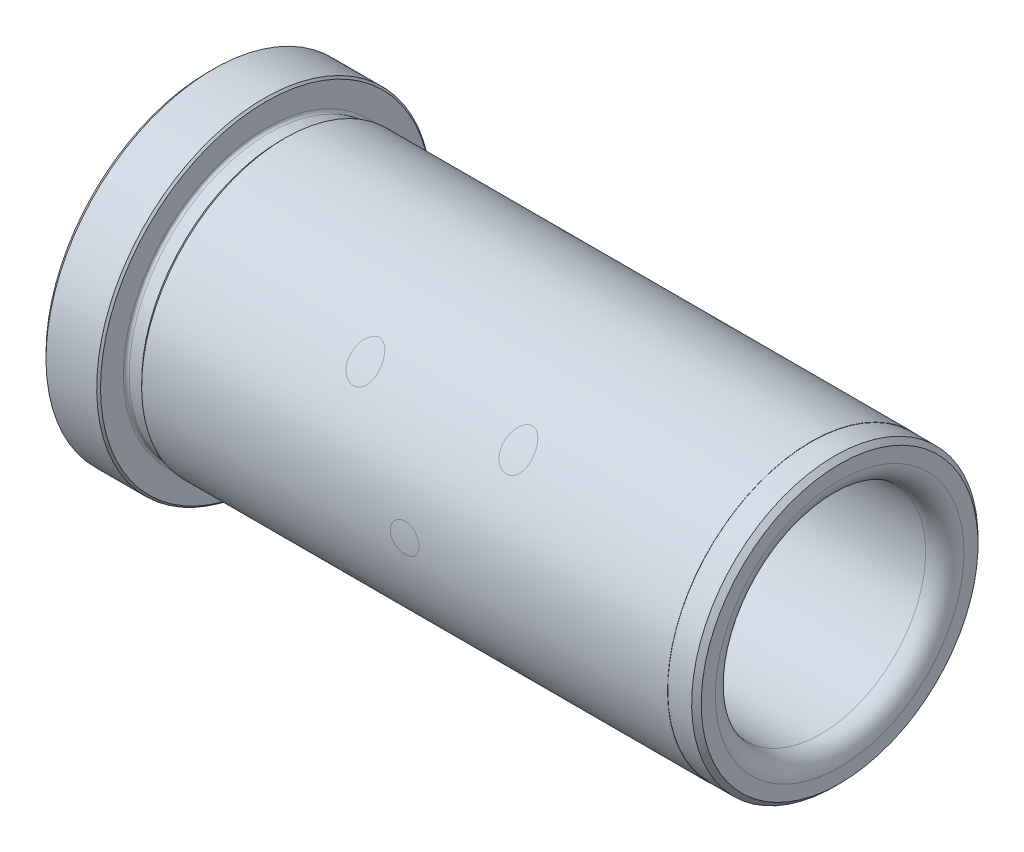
ISO-10303-21;
HEADER;
FILE_DESCRIPTION(('STEP AP214'),'2;1');
FILE_NAME('part.step','',(''),(''),'','','');
FILE_SCHEMA(('AUTOMOTIVE_DESIGN { 1 0 10303 214 1 1 1 1 }'));
ENDSEC;
DATA;
#1=APPLICATION_CONTEXT('core data for automotive mechanical design processes');
#2=APPLICATION_PROTOCOL_DEFINITION('international standard','automotive_design',2000,#1);
#3=PRODUCT_CONTEXT('',#1,'mechanical');
#4=PRODUCT('Part','Part','',(#3));
#5=PRODUCT_RELATED_PRODUCT_CATEGORY('part','',(#4));
#6=PRODUCT_DEFINITION_FORMATION('','',#4);
#7=PRODUCT_DEFINITION_CONTEXT('part definition',#1,'design');
#8=PRODUCT_DEFINITION('design','',#6,#7);
#9=PRODUCT_DEFINITION_SHAPE('','',#8);
#10=(LENGTH_UNIT() NAMED_UNIT(*) SI_UNIT(.MILLI.,.METRE.));
#11=(NAMED_UNIT(*) PLANE_ANGLE_UNIT() SI_UNIT($,.RADIAN.));
#12=(NAMED_UNIT(*) SI_UNIT($,.STERADIAN.) SOLID_ANGLE_UNIT());
#13=UNCERTAINTY_MEASURE_WITH_UNIT(LENGTH_MEASURE(1.E-05),#10,'distance_accuracy_value','');
#14=(GEOMETRIC_REPRESENTATION_CONTEXT(3) GLOBAL_UNCERTAINTY_ASSIGNED_CONTEXT((#13)) GLOBAL_UNIT_ASSIGNED_CONTEXT((#10,
#11,#12)) REPRESENTATION_CONTEXT('',''));
#15=CARTESIAN_POINT('',(0.,0.,0.));
#16=DIRECTION('',(0.,0.,1.));
#17=DIRECTION('',(1.,0.,0.));
#18=AXIS2_PLACEMENT_3D('',#15,#16,#17);
#19=CARTESIAN_POINT('',(33.,0.,0.));
#20=DIRECTION('',(1.,0.,0.));
#21=DIRECTION('',(0.,1.,0.));
#22=AXIS2_PLACEMENT_3D('',#19,#20,#21);
#23=CYLINDRICAL_SURFACE('',#22,15.);
#24=CARTESIAN_POINT('',(1.,0.,-15.));
#25=CARTESIAN_POINT('',(1.00000363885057,-0.0840305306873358,-14.9999990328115));
#26=CARTESIAN_POINT('',(1.00708490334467,-0.16811661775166,-14.9992863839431));
#27=CARTESIAN_POINT('',(1.03522655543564,-0.333957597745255,-14.9965120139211));
#28=CARTESIAN_POINT('',(1.05630234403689,-0.415709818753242,-14.9944488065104));
#29=CARTESIAN_POINT('',(1.11181336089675,-0.574457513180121,-14.989206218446));
#30=CARTESIAN_POINT('',(1.14624052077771,-0.651455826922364,-14.9860275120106));
#31=CARTESIAN_POINT('',(1.22746136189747,-0.79856424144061,-14.9789093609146));
#32=CARTESIAN_POINT('',(1.27425258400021,-0.868675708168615,-14.974970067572));
#33=CARTESIAN_POINT('',(1.37905404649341,-1.00028932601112,-14.9667561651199));
#34=CARTESIAN_POINT('',(1.43709969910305,-1.06176321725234,-14.962480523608));
#35=CARTESIAN_POINT('',(1.56268680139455,-1.17411378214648,-14.9540843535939));
#36=CARTESIAN_POINT('',(1.63022869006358,-1.22498996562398,-14.9499638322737));
#37=CARTESIAN_POINT('',(1.77306779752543,-1.31480095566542,-14.9423338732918));
#38=CARTESIAN_POINT('',(1.84838116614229,-1.35371019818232,-14.9388257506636));
#39=CARTESIAN_POINT('',(2.00451337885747,-1.41831957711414,-14.9328305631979));
#40=CARTESIAN_POINT('',(2.08533208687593,-1.44402003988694,-14.9303434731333));
#41=CARTESIAN_POINT('',(2.24989270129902,-1.48139856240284,-14.9266812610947));
#42=CARTESIAN_POINT('',(2.33362386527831,-1.49312347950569,-14.9255017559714));
#43=CARTESIAN_POINT('',(2.50187329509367,-1.50236292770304,-14.9245746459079));
#44=CARTESIAN_POINT('',(2.58639154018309,-1.4998778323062,-14.9248270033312));
#45=CARTESIAN_POINT('',(2.75349296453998,-1.48080642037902,-14.926731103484));
#46=CARTESIAN_POINT('',(2.83608204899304,-1.46427126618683,-14.9283777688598));
#47=CARTESIAN_POINT('',(2.99730694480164,-1.41764871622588,-14.9328770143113));
#48=CARTESIAN_POINT('',(3.07594270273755,-1.38756113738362,-14.9357296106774));
#49=CARTESIAN_POINT('',(3.22719038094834,-1.31463134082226,-14.942325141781));
#50=CARTESIAN_POINT('',(3.29979128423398,-1.27176642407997,-14.9460696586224));
#51=CARTESIAN_POINT('',(3.43678782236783,-1.17451504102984,-14.9540257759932));
#52=CARTESIAN_POINT('',(3.50118321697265,-1.12012823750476,-14.9582373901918));
#53=CARTESIAN_POINT('',(3.62023809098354,-1.0010911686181,-14.9666757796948));
#54=CARTESIAN_POINT('',(3.67485340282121,-0.936396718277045,-14.970902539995));
#55=CARTESIAN_POINT('',(3.77245544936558,-0.798734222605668,-14.9788774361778));
#56=CARTESIAN_POINT('',(3.81544217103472,-0.725766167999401,-14.9826255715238));
#57=CARTESIAN_POINT('',(3.88856503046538,-0.573597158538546,-14.9892221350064));
#58=CARTESIAN_POINT('',(3.91869892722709,-0.494395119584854,-14.9920704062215));
#59=CARTESIAN_POINT('',(3.96522837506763,-0.332020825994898,-14.9965447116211));
#60=CARTESIAN_POINT('',(3.98162433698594,-0.2488486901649,-14.9981707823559));
#61=CARTESIAN_POINT('',(4.00015646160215,-0.0812776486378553,-15.0000127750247));
#62=CARTESIAN_POINT('',(4.00235357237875,0.00311445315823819,-15.000234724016));
#63=CARTESIAN_POINT('',(3.99258570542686,0.17106568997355,-14.9992596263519));
#64=CARTESIAN_POINT('',(3.98062091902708,0.254624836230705,-14.998062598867));
#65=CARTESIAN_POINT('',(3.94291945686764,0.418362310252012,-14.9943879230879));
#66=CARTESIAN_POINT('',(3.91721131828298,0.498547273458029,-14.9919129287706));
#67=CARTESIAN_POINT('',(3.85278223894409,0.653466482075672,-14.9859599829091));
#68=CARTESIAN_POINT('',(3.81406100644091,0.728200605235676,-14.9824820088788));
#69=CARTESIAN_POINT('',(3.72455374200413,0.870372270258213,-14.9748971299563));
#70=CARTESIAN_POINT('',(3.67372766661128,0.937784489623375,-14.9707881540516));
#71=CARTESIAN_POINT('',(3.56151089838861,1.06314243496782,-14.9624089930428));
#72=CARTESIAN_POINT('',(3.50011994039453,1.12108792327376,-14.9581388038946));
#73=CARTESIAN_POINT('',(3.3682501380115,1.22607916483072,-14.9499003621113));
#74=CARTESIAN_POINT('',(3.29773936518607,1.27308491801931,-14.9459332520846));
#75=CARTESIAN_POINT('',(3.14978895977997,1.35458738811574,-14.9387674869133));
#76=CARTESIAN_POINT('',(3.07234942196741,1.38908427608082,-14.9355688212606));
#77=CARTESIAN_POINT('',(2.91287689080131,1.44452281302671,-14.9303092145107));
#78=CARTESIAN_POINT('',(2.83085223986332,1.46548826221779,-14.9282462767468));
#79=CARTESIAN_POINT('',(2.66442520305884,1.49334601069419,-14.9254854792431));
#80=CARTESIAN_POINT('',(2.58002288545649,1.50023871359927,-14.9247875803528));
#81=CARTESIAN_POINT('',(2.41163396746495,1.49974970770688,-14.9248366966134));
#82=CARTESIAN_POINT('',(2.32764717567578,1.49243083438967,-14.9255773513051));
#83=CARTESIAN_POINT('',(2.16210262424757,1.46385817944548,-14.9284065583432));
#84=CARTESIAN_POINT('',(2.08054486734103,1.44260438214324,-14.9304951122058));
#85=CARTESIAN_POINT('',(1.92217397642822,1.38678252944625,-14.9357830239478));
#86=CARTESIAN_POINT('',(1.84536018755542,1.35221631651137,-14.9389822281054));
#87=CARTESIAN_POINT('',(1.69861466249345,1.27075733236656,-14.9461312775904));
#88=CARTESIAN_POINT('',(1.62868288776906,1.22386463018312,-14.9500811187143));
#89=CARTESIAN_POINT('',(1.4973644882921,1.118847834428,-14.9583073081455));
#90=CARTESIAN_POINT('',(1.43601538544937,1.0606769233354,-14.9625849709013));
#91=CARTESIAN_POINT('',(1.32392165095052,0.934847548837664,-14.9709728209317));
#92=CARTESIAN_POINT('',(1.27317956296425,0.867186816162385,-14.9750829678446));
#93=CARTESIAN_POINT('',(1.18363981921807,0.724112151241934,-14.9826834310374));
#94=CARTESIAN_POINT('',(1.14487256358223,0.648679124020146,-14.9861721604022));
#95=CARTESIAN_POINT('',(1.0806063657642,0.492387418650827,-14.9921194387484));
#96=CARTESIAN_POINT('',(1.05509246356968,0.411534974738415,-14.9945791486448));
#97=CARTESIAN_POINT('',(1.0244190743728,0.275187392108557,-14.997573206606));
#98=CARTESIAN_POINT('',(1.01527443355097,0.220563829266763,-14.9984790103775));
#99=CARTESIAN_POINT('',(1.00306371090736,0.11063487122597,-14.9996927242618));
#100=CARTESIAN_POINT('',(0.99999760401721,0.0553294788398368,-15.0000006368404));
#101=CARTESIAN_POINT('',(1.,0.,-15.));
#102=B_SPLINE_CURVE_WITH_KNOTS('',3,(#24,#25,#26,#27,#28,#29,#30,#31,#32,#33,#34,#35,#36,#37,
#38,#39,#40,#41,#42,#43,#44,#45,#46,#47,#48,#49,#50,#51,#52,#53,#54,#55,#56,#57,#58,#59,#60,#61,
#62,#63,#64,#65,#66,#67,#68,#69,#70,#71,#72,#73,#74,#75,#76,#77,#78,#79,#80,#81,#82,#83,#84,#85,
#86,#87,#88,#89,#90,#91,#92,#93,#94,#95,#96,#97,#98,#99,#100,#101),.UNSPECIFIED.,.T.,.F.,(4,2,2,
2,2,2,2,2,2,2,2,2,2,2,2,2,2,2,2,2,2,2,2,2,2,2,2,2,2,2,2,2,2,2,2,2,2,2,4),(0.,0.251889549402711,
0.504056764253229,0.756071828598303,1.00803680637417,1.26080785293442,1.51359058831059,
1.76690963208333,2.02022241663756,2.27268348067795,2.52513790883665,2.77667696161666,
3.0282194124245,3.28021142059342,3.53221080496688,3.7853210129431,4.03843150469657,
4.29158611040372,4.54473314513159,4.79679282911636,5.04884910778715,5.30038402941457,
5.551924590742,5.80430911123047,6.05669996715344,6.30999965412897,6.56329587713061,
6.81614535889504,7.06898758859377,7.32071443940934,7.57244157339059,7.824133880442,
8.0758247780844,8.32858376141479,8.58140328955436,8.83485946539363,9.08802892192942,
9.25388500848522,9.4197404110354),.UNSPECIFIED.);
#103=CARTESIAN_POINT('',(1.,0.,-15.));
#104=VERTEX_POINT('',#103);
#105=EDGE_CURVE('E34',#104,#104,#102,.T.);
#106=ORIENTED_EDGE('',*,*,#105,.T.);
#107=EDGE_LOOP('',(#106));
#108=FACE_BOUND('',#107,.T.);
#109=CARTESIAN_POINT('',(8.99999999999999,-10.,-11.1803398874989));
#110=CARTESIAN_POINT('',(8.99999745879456,-10.1151541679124,-11.0773364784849));
#111=CARTESIAN_POINT('',(9.01323170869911,-10.2288341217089,-10.9724276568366));
#112=CARTESIAN_POINT('',(9.06462899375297,-10.4502109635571,-10.7618101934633));
#113=CARTESIAN_POINT('',(9.10287317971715,-10.5578871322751,-10.6561000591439));
#114=CARTESIAN_POINT('',(9.19554045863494,-10.7466480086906,-10.4653910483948));
#115=CARTESIAN_POINT('',(9.24612112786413,-10.8291459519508,-10.3799193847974));
#116=CARTESIAN_POINT('',(9.36513495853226,-10.9857652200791,-10.214003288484));
#117=CARTESIAN_POINT('',(9.43352003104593,-11.0599083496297,-10.1335460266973));
#118=CARTESIAN_POINT('',(9.56242127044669,-11.172818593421,-10.0086253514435));
#119=CARTESIAN_POINT('',(9.6173566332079,-11.2149021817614,-9.96139868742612));
#120=CARTESIAN_POINT('',(9.73596104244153,-11.2927735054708,-9.87302934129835));
#121=CARTESIAN_POINT('',(9.79961784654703,-11.3285699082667,-9.83187829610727));
#122=CARTESIAN_POINT('',(9.92019044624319,-11.3846206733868,-9.76687387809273));
#123=CARTESIAN_POINT('',(9.9753377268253,-11.4065579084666,-9.74121559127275));
#124=CARTESIAN_POINT('',(10.0903934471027,-11.4442563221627,-9.69689874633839));
#125=CARTESIAN_POINT('',(10.150297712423,-11.4600228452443,-9.67823413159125));
#126=CARTESIAN_POINT('',(10.274268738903,-11.4842727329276,-9.64944810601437));
#127=CARTESIAN_POINT('',(10.3383709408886,-11.4926821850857,-9.639413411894));
#128=CARTESIAN_POINT('',(10.467890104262,-11.5010554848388,-9.62942225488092));
#129=CARTESIAN_POINT('',(10.5333058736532,-11.5010266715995,-9.6294570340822));
#130=CARTESIAN_POINT('',(10.6530775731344,-11.4931927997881,-9.63880381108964));
#131=CARTESIAN_POINT('',(10.7076287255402,-11.4865474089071,-9.64673229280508));
#132=CARTESIAN_POINT('',(10.8143587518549,-11.4676917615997,-9.66913952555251));
#133=CARTESIAN_POINT('',(10.8665364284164,-11.4554787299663,-9.68362154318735));
#134=CARTESIAN_POINT('',(10.9840106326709,-11.4214748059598,-9.72372361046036));
#135=CARTESIAN_POINT('',(11.0480610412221,-11.3978612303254,-9.75143373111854));
#136=CARTESIAN_POINT('',(11.1694637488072,-11.3439690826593,-9.81407556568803));
#137=CARTESIAN_POINT('',(11.2268021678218,-11.3136770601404,-9.84902184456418));
#138=CARTESIAN_POINT('',(11.3585154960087,-11.2333896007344,-9.94062805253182));
#139=CARTESIAN_POINT('',(11.4292404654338,-11.1805986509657,-10.0000641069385));
#140=CARTESIAN_POINT('',(11.5574908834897,-11.0672666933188,-10.1253548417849));
#141=CARTESIAN_POINT('',(11.6149897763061,-11.0067104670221,-10.1912220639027));
#142=CARTESIAN_POINT('',(11.737377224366,-10.8553717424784,-10.3526475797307));
#143=CARTESIAN_POINT('',(11.7966732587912,-10.7618903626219,-10.4499221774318));
#144=CARTESIAN_POINT('',(11.8930587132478,-10.5667713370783,-10.6471911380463));
#145=CARTESIAN_POINT('',(11.9301278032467,-10.4651263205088,-10.7471879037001));
#146=CARTESIAN_POINT('',(11.9822858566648,-10.2544909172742,-10.9483753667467));
#147=CARTESIAN_POINT('',(11.997046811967,-10.1454151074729,-11.0495622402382));
#148=CARTESIAN_POINT('',(12.0021507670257,-9.92396743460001,-11.2488656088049));
#149=CARTESIAN_POINT('',(11.9925212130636,-9.81159941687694,-11.3469854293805));
#150=CARTESIAN_POINT('',(11.9514233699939,-9.61067740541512,-11.5173116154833));
#151=CARTESIAN_POINT('',(11.9249439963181,-9.52205820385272,-11.5906455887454));
#152=CARTESIAN_POINT('',(11.8539713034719,-9.34761891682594,-11.731774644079));
#153=CARTESIAN_POINT('',(11.8095000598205,-9.26179553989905,-11.7995763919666));
#154=CARTESIAN_POINT('',(11.7122444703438,-9.11303090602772,-11.9146844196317));
#155=CARTESIAN_POINT('',(11.6628792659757,-9.04893641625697,-11.9633833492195));
#156=CARTESIAN_POINT('',(11.5517118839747,-8.92730814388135,-12.054414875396));
#157=CARTESIAN_POINT('',(11.4899232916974,-8.86976730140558,-12.0967543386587));
#158=CARTESIAN_POINT('',(11.3651266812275,-8.77248543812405,-12.1674377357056));
#159=CARTESIAN_POINT('',(11.3038489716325,-8.73136840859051,-12.1969358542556));
#160=CARTESIAN_POINT('',(11.1737150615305,-8.65773049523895,-12.2493161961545));
#161=CARTESIAN_POINT('',(11.1048613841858,-8.6252067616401,-12.2722006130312));
#162=CARTESIAN_POINT('',(10.9607371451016,-8.57042166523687,-12.3105242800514));
#163=CARTESIAN_POINT('',(10.8854332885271,-8.54821788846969,-12.3259217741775));
#164=CARTESIAN_POINT('',(10.7310795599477,-8.51581346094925,-12.3483327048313));
#165=CARTESIAN_POINT('',(10.6520315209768,-8.50560699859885,-12.355350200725));
#166=CARTESIAN_POINT('',(10.5010219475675,-8.49828946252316,-12.3603837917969));
#167=CARTESIAN_POINT('',(10.4291434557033,-8.49996938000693,-12.3592309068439));
#168=CARTESIAN_POINT('',(10.2868313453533,-8.51350593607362,-12.3499102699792));
#169=CARTESIAN_POINT('',(10.2163974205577,-8.52536039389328,-12.3417440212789));
#170=CARTESIAN_POINT('',(10.080560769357,-8.55818033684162,-12.3190069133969));
#171=CARTESIAN_POINT('',(10.0150794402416,-8.57892921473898,-12.304588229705));
#172=CARTESIAN_POINT('',(9.88889153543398,-8.62845187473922,-12.2699114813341));
#173=CARTESIAN_POINT('',(9.82818597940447,-8.65722736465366,-12.2496521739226));
#174=CARTESIAN_POINT('',(9.70848923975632,-8.72386005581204,-12.2022967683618));
#175=CARTESIAN_POINT('',(9.64993264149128,-8.76222028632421,-12.1748147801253));
#176=CARTESIAN_POINT('',(9.5403374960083,-8.84510802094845,-12.1147300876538));
#177=CARTESIAN_POINT('',(9.48930122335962,-8.88963738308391,-12.0821258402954));
#178=CARTESIAN_POINT('',(9.38823355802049,-8.99016590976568,-12.0075545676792));
#179=CARTESIAN_POINT('',(9.33942394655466,-9.04689168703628,-11.9649154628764));
#180=CARTESIAN_POINT('',(9.25206698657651,-9.16450995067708,-11.8750688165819));
#181=CARTESIAN_POINT('',(9.21353244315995,-9.22540751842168,-11.8278556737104));
#182=CARTESIAN_POINT('',(9.13060746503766,-9.37905844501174,-11.7066975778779));
#183=CARTESIAN_POINT('',(9.09202019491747,-9.4732956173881,-11.6306431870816));
#184=CARTESIAN_POINT('',(9.03492941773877,-9.66323379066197,-11.4733227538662));
#185=CARTESIAN_POINT('',(9.01641819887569,-9.75893421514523,-11.3920587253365));
#186=CARTESIAN_POINT('',(9.00234418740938,-9.90286312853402,-11.2666566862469));
#187=CARTESIAN_POINT('',(9.00000106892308,-9.95156198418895,-11.223666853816));
#188=CARTESIAN_POINT('',(8.99999999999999,-10.,-11.1803398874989));
#189=B_SPLINE_CURVE_WITH_KNOTS('',3,(#109,#110,#111,#112,#113,#114,#115,#116,#117,#118,#119,
#120,#121,#122,#123,#124,#125,#126,#127,#128,#129,#130,#131,#132,#133,#134,#135,#136,#137,#138,
#139,#140,#141,#142,#143,#144,#145,#146,#147,#148,#149,#150,#151,#152,#153,#154,#155,#156,#157,
#158,#159,#160,#161,#162,#163,#164,#165,#166,#167,#168,#169,#170,#171,#172,#173,#174,#175,#176,
#177,#178,#179,#180,#181,#182,#183,#184,#185,#186,#187,#188),.UNSPECIFIED.,.T.,.F.,(4,2,2,2,2,2,
2,2,2,2,2,2,2,2,2,2,2,2,2,2,2,2,2,2,2,2,2,2,2,2,2,2,2,2,2,2,2,2,2,4),(0.,0.463320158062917,
0.928151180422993,1.31417206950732,1.69916095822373,1.94981111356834,2.20011296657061,
2.39338723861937,2.58649374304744,2.78151871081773,2.97637405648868,3.14218675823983,
3.30808220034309,3.52788152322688,3.74812763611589,4.06557972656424,4.38366375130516,
4.82347243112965,5.26368277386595,5.71030485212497,6.15642457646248,6.50923643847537,
6.86161671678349,7.14382282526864,7.42572199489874,7.66314706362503,7.90049329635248,
8.13914849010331,8.37768802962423,8.5923404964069,8.80694696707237,9.01660009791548,
9.22629787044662,9.45102260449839,9.67581516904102,9.93324580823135,10.1909957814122,
10.5702538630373,10.9493662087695,11.144255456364),.UNSPECIFIED.);
#190=CARTESIAN_POINT('',(8.99999999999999,-10.,-11.1803398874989));
#191=VERTEX_POINT('',#190);
#192=EDGE_CURVE('E51',#191,#191,#189,.T.);
#193=ORIENTED_EDGE('',*,*,#192,.T.);
#194=EDGE_LOOP('',(#193));
#195=FACE_BOUND('',#194,.T.);
#196=CARTESIAN_POINT('',(-7.,-10.,-11.1803398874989));
#197=CARTESIAN_POINT('',(-7.00000254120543,-10.1151541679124,-11.0773364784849));
#198=CARTESIAN_POINT('',(-6.98676829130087,-10.2288341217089,-10.9724276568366));
#199=CARTESIAN_POINT('',(-6.93537100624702,-10.4502109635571,-10.7618101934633));
#200=CARTESIAN_POINT('',(-6.89712682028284,-10.5578871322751,-10.6561000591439));
#201=CARTESIAN_POINT('',(-6.80445954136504,-10.7466480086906,-10.4653910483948));
#202=CARTESIAN_POINT('',(-6.75387887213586,-10.8291459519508,-10.3799193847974));
#203=CARTESIAN_POINT('',(-6.63486504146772,-10.9857652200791,-10.214003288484));
#204=CARTESIAN_POINT('',(-6.56647996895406,-11.0599083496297,-10.1335460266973));
#205=CARTESIAN_POINT('',(-6.43757872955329,-11.172818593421,-10.0086253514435));
#206=CARTESIAN_POINT('',(-6.38264336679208,-11.2149021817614,-9.96139868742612));
#207=CARTESIAN_POINT('',(-6.26403895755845,-11.2927735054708,-9.87302934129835));
#208=CARTESIAN_POINT('',(-6.20038215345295,-11.3285699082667,-9.83187829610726));
#209=CARTESIAN_POINT('',(-6.07980955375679,-11.3846206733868,-9.76687387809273));
#210=CARTESIAN_POINT('',(-6.02466227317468,-11.4065579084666,-9.74121559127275));
#211=CARTESIAN_POINT('',(-5.90960655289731,-11.4442563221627,-9.69689874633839));
#212=CARTESIAN_POINT('',(-5.84970228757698,-11.4600228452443,-9.67823413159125));
#213=CARTESIAN_POINT('',(-5.72573126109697,-11.4842727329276,-9.64944810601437));
#214=CARTESIAN_POINT('',(-5.66162905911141,-11.4926821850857,-9.639413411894));
#215=CARTESIAN_POINT('',(-5.53210989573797,-11.5010554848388,-9.62942225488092));
#216=CARTESIAN_POINT('',(-5.46669412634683,-11.5010266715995,-9.6294570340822));
#217=CARTESIAN_POINT('',(-5.34692242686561,-11.4931927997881,-9.63880381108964));
#218=CARTESIAN_POINT('',(-5.2923712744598,-11.4865474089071,-9.64673229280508));
#219=CARTESIAN_POINT('',(-5.18564124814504,-11.4676917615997,-9.66913952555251));
#220=CARTESIAN_POINT('',(-5.13346357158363,-11.4554787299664,-9.68362154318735));
#221=CARTESIAN_POINT('',(-5.01598936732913,-11.4214748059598,-9.72372361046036));
#222=CARTESIAN_POINT('',(-4.95193895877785,-11.3978612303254,-9.75143373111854));
#223=CARTESIAN_POINT('',(-4.83053625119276,-11.3439690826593,-9.81407556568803));
#224=CARTESIAN_POINT('',(-4.77319783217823,-11.3136770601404,-9.84902184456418));
#225=CARTESIAN_POINT('',(-4.64148450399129,-11.2333896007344,-9.94062805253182));
#226=CARTESIAN_POINT('',(-4.57075953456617,-11.1805986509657,-10.0000641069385));
#227=CARTESIAN_POINT('',(-4.44250911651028,-11.0672666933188,-10.1253548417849));
#228=CARTESIAN_POINT('',(-4.38501022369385,-11.0067104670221,-10.1912220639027));
#229=CARTESIAN_POINT('',(-4.26262277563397,-10.8553717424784,-10.3526475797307));
#230=CARTESIAN_POINT('',(-4.20332674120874,-10.7618903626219,-10.4499221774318));
#231=CARTESIAN_POINT('',(-4.10694128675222,-10.5667713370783,-10.6471911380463));
#232=CARTESIAN_POINT('',(-4.06987219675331,-10.4651263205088,-10.7471879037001));
#233=CARTESIAN_POINT('',(-4.01771414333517,-10.2544909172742,-10.9483753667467));
#234=CARTESIAN_POINT('',(-4.002953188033,-10.1454151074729,-11.0495622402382));
#235=CARTESIAN_POINT('',(-3.99784923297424,-9.92396743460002,-11.2488656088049));
#236=CARTESIAN_POINT('',(-4.00747878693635,-9.81159941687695,-11.3469854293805));
#237=CARTESIAN_POINT('',(-4.04857663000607,-9.61067740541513,-11.5173116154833));
#238=CARTESIAN_POINT('',(-4.07505600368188,-9.52205820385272,-11.5906455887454));
#239=CARTESIAN_POINT('',(-4.14602869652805,-9.34761891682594,-11.731774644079));
#240=CARTESIAN_POINT('',(-4.19049994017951,-9.26179553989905,-11.7995763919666));
#241=CARTESIAN_POINT('',(-4.28775552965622,-9.11303090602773,-11.9146844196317));
#242=CARTESIAN_POINT('',(-4.33712073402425,-9.04893641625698,-11.9633833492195));
#243=CARTESIAN_POINT('',(-4.44828811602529,-8.92730814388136,-12.054414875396));
#244=CARTESIAN_POINT('',(-4.51007670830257,-8.86976730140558,-12.0967543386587));
#245=CARTESIAN_POINT('',(-4.63487331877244,-8.77248543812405,-12.1674377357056));
#246=CARTESIAN_POINT('',(-4.69615102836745,-8.73136840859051,-12.1969358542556));
#247=CARTESIAN_POINT('',(-4.82628493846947,-8.65773049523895,-12.2493161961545));
#248=CARTESIAN_POINT('',(-4.8951386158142,-8.6252067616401,-12.2722006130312));
#249=CARTESIAN_POINT('',(-5.03926285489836,-8.57042166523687,-12.3105242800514));
#250=CARTESIAN_POINT('',(-5.1145667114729,-8.54821788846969,-12.3259217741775));
#251=CARTESIAN_POINT('',(-5.2689204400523,-8.51581346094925,-12.3483327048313));
#252=CARTESIAN_POINT('',(-5.34796847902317,-8.50560699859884,-12.355350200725));
#253=CARTESIAN_POINT('',(-5.4989780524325,-8.49828946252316,-12.3603837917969));
#254=CARTESIAN_POINT('',(-5.57085654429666,-8.49996938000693,-12.3592309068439));
#255=CARTESIAN_POINT('',(-5.71316865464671,-8.51350593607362,-12.3499102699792));
#256=CARTESIAN_POINT('',(-5.78360257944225,-8.52536039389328,-12.341744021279));
#257=CARTESIAN_POINT('',(-5.91943923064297,-8.55818033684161,-12.3190069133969));
#258=CARTESIAN_POINT('',(-5.98492055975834,-8.57892921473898,-12.3045882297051));
#259=CARTESIAN_POINT('',(-6.111108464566,-8.62845187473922,-12.2699114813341));
#260=CARTESIAN_POINT('',(-6.17181402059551,-8.65722736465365,-12.2496521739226));
#261=CARTESIAN_POINT('',(-6.29151076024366,-8.72386005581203,-12.2022967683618));
#262=CARTESIAN_POINT('',(-6.3500673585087,-8.7622202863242,-12.1748147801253));
#263=CARTESIAN_POINT('',(-6.45966250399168,-8.84510802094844,-12.1147300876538));
#264=CARTESIAN_POINT('',(-6.51069877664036,-8.88963738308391,-12.0821258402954));
#265=CARTESIAN_POINT('',(-6.61176644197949,-8.99016590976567,-12.0075545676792));
#266=CARTESIAN_POINT('',(-6.66057605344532,-9.04689168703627,-11.9649154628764));
#267=CARTESIAN_POINT('',(-6.74793301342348,-9.16450995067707,-11.8750688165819));
#268=CARTESIAN_POINT('',(-6.78646755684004,-9.22540751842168,-11.8278556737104));
#269=CARTESIAN_POINT('',(-6.86939253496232,-9.37905844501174,-11.7066975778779));
#270=CARTESIAN_POINT('',(-6.90797980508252,-9.47329561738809,-11.6306431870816));
#271=CARTESIAN_POINT('',(-6.96507058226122,-9.66323379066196,-11.4733227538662));
#272=CARTESIAN_POINT('',(-6.98358180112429,-9.75893421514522,-11.3920587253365));
#273=CARTESIAN_POINT('',(-6.9976558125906,-9.90286312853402,-11.2666566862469));
#274=CARTESIAN_POINT('',(-6.99999893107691,-9.95156198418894,-11.223666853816));
#275=CARTESIAN_POINT('',(-7.,-10.,-11.1803398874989));
#276=B_SPLINE_CURVE_WITH_KNOTS('',3,(#196,#197,#198,#199,#200,#201,#202,#203,#204,#205,#206,
#207,#208,#209,#210,#211,#212,#213,#214,#215,#216,#217,#218,#219,#220,#221,#222,#223,#224,#225,
#226,#227,#228,#229,#230,#231,#232,#233,#234,#235,#236,#237,#238,#239,#240,#241,#242,#243,#244,
#245,#246,#247,#248,#249,#250,#251,#252,#253,#254,#255,#256,#257,#258,#259,#260,#261,#262,#263,
#264,#265,#266,#267,#268,#269,#270,#271,#272,#273,#274,#275),.UNSPECIFIED.,.T.,.F.,(4,2,2,2,2,2,
2,2,2,2,2,2,2,2,2,2,2,2,2,2,2,2,2,2,2,2,2,2,2,2,2,2,2,2,2,2,2,2,2,4),(0.,0.463320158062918,
0.928151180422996,1.31417206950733,1.69916095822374,1.94981111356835,2.20011296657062,
2.39338723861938,2.58649374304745,2.78151871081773,2.97637405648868,3.14218675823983,
3.30808220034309,3.52788152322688,3.7481276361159,4.06557972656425,4.38366375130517,
4.82347243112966,5.26368277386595,5.71030485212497,6.15642457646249,6.50923643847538,
6.8616167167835,7.14382282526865,7.42572199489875,7.66314706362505,7.9004932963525,
8.13914849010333,8.37768802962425,8.59234049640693,8.80694696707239,9.01660009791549,
9.22629787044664,9.45102260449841,9.67581516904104,9.93324580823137,10.1909957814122,
10.5702538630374,10.9493662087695,11.1442554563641),.UNSPECIFIED.);
#277=CARTESIAN_POINT('',(-7.,-10.,-11.1803398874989));
#278=VERTEX_POINT('',#277);
#279=EDGE_CURVE('E98',#278,#278,#276,.T.);
#280=ORIENTED_EDGE('',*,*,#279,.T.);
#281=EDGE_LOOP('',(#280));
#282=FACE_BOUND('',#281,.T.);
#283=CARTESIAN_POINT('',(8.99999999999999,10.,-11.1803398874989));
#284=CARTESIAN_POINT('',(8.99999862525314,9.90545385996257,-11.2649011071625));
#285=CARTESIAN_POINT('',(9.00892105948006,9.80976246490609,-11.3483188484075));
#286=CARTESIAN_POINT('',(9.04609932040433,9.61831530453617,-11.5110292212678));
#287=CARTESIAN_POINT('',(9.074375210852,9.5225595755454,-11.5903174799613));
#288=CARTESIAN_POINT('',(9.14515271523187,9.3508124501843,-11.7291221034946));
#289=CARTESIAN_POINT('',(9.18430992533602,9.27428853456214,-11.7896739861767));
#290=CARTESIAN_POINT('',(9.27772633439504,9.1261052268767,-11.9047453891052));
#291=CARTESIAN_POINT('',(9.3319612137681,9.05443823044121,-11.95927442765));
#292=CARTESIAN_POINT('',(9.44476200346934,8.93128607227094,-12.0514301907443));
#293=CARTESIAN_POINT('',(9.50083297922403,8.87848051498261,-12.0903372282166));
#294=CARTESIAN_POINT('',(9.62303337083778,8.7805533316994,-12.1616425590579));
#295=CARTESIAN_POINT('',(9.68916101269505,8.73543035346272,-12.1940419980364));
#296=CARTESIAN_POINT('',(9.83093049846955,8.65499665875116,-12.2512652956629));
#297=CARTESIAN_POINT('',(9.90664069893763,8.61976295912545,-12.2760298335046));
#298=CARTESIAN_POINT('',(10.0650403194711,8.5619822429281,-12.316400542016));
#299=CARTESIAN_POINT('',(10.1477234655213,8.53942395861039,-12.3320148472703));
#300=CARTESIAN_POINT('',(10.3055969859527,8.51078437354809,-12.3517936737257));
#301=CARTESIAN_POINT('',(10.3803074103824,8.50290069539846,-12.3572117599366));
#302=CARTESIAN_POINT('',(10.5302107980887,8.49843409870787,-12.3602843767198));
#303=CARTESIAN_POINT('',(10.6054035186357,8.50184588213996,-12.357942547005));
#304=CARTESIAN_POINT('',(10.7486282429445,8.51911277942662,-12.3460443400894));
#305=CARTESIAN_POINT('',(10.8167950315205,8.53222664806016,-12.3369999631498));
#306=CARTESIAN_POINT('',(10.9496180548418,8.56732321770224,-12.3126530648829));
#307=CARTESIAN_POINT('',(11.0142741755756,8.58930620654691,-12.2973503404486));
#308=CARTESIAN_POINT('',(11.1407571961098,8.6419561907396,-12.2604100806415));
#309=CARTESIAN_POINT('',(11.2024128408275,8.67289334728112,-12.2385746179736));
#310=CARTESIAN_POINT('',(11.3193440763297,8.741713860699,-12.1895128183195));
#311=CARTESIAN_POINT('',(11.3746175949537,8.779599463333,-12.1622847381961));
#312=CARTESIAN_POINT('',(11.4841973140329,8.86564663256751,-12.0997292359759));
#313=CARTESIAN_POINT('',(11.5376363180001,8.91449160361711,-12.0638272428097));
#314=CARTESIAN_POINT('',(11.635428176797,9.0172263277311,-11.987232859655));
#315=CARTESIAN_POINT('',(11.6797746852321,9.07111956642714,-11.9465371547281));
#316=CARTESIAN_POINT('',(11.7770395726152,9.20697073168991,-11.8423748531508));
#317=CARTESIAN_POINT('',(11.8250904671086,9.29080921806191,-11.7767907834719));
#318=CARTESIAN_POINT('',(11.9033518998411,9.46195288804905,-11.639739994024));
#319=CARTESIAN_POINT('',(11.9335289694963,9.5492642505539,-11.5682625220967));
#320=CARTESIAN_POINT('',(11.9825826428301,9.7459140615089,-11.4033904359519));
#321=CARTESIAN_POINT('',(11.9969343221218,9.85545181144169,-11.3088891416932));
#322=CARTESIAN_POINT('',(12.0021887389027,10.0720160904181,-11.1164541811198));
#323=CARTESIAN_POINT('',(11.9930702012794,10.179040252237,-11.0185174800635));
#324=CARTESIAN_POINT('',(11.9526526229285,10.3890427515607,-10.8207582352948));
#325=CARTESIAN_POINT('',(11.921129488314,10.4919690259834,-10.7209266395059));
#326=CARTESIAN_POINT('',(11.8360828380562,10.6903085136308,-10.5231576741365));
#327=CARTESIAN_POINT('',(11.7825753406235,10.7857271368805,-10.4252189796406));
#328=CARTESIAN_POINT('',(11.6698526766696,10.9424107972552,-10.2602633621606));
#329=CARTESIAN_POINT('',(11.615870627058,11.0060435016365,-10.191907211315));
#330=CARTESIAN_POINT('',(11.4946264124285,11.1260452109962,-10.0607629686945));
#331=CARTESIAN_POINT('',(11.4273871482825,11.1824264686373,-9.99796554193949));
#332=CARTESIAN_POINT('',(11.3008702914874,11.2698906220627,-9.89911889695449));
#333=CARTESIAN_POINT('',(11.245215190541,11.3034993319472,-9.86068336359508));
#334=CARTESIAN_POINT('',(11.1267157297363,11.3644222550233,-9.7904064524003));
#335=CARTESIAN_POINT('',(11.0638824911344,11.3917460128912,-9.75855508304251));
#336=CARTESIAN_POINT('',(10.9453392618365,11.4334416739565,-9.70964611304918));
#337=CARTESIAN_POINT('',(10.8908717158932,11.4493258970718,-9.69088896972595));
#338=CARTESIAN_POINT('',(10.7786115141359,11.4750188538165,-9.66045252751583));
#339=CARTESIAN_POINT('',(10.7208220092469,11.4848332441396,-9.64876663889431));
#340=CARTESIAN_POINT('',(10.6030520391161,11.4976331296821,-9.63351122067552));
#341=CARTESIAN_POINT('',(10.5430606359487,11.5005778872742,-9.6299901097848));
#342=CARTESIAN_POINT('',(10.4232760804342,11.4992332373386,-9.63159570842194));
#343=CARTESIAN_POINT('',(10.3634829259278,11.4949439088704,-9.63672232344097));
#344=CARTESIAN_POINT('',(10.2513047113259,11.4802262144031,-9.65424863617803));
#345=CARTESIAN_POINT('',(10.198731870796,11.4703737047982,-9.6659657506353));
#346=CARTESIAN_POINT('',(10.0964836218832,11.4456644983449,-9.69521172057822));
#347=CARTESIAN_POINT('',(10.0468095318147,11.430805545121,-9.71274319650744));
#348=CARTESIAN_POINT('',(9.92909842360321,11.3890832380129,-9.76167101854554));
#349=CARTESIAN_POINT('',(9.86302075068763,11.3598358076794,-9.79574401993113));
#350=CARTESIAN_POINT('',(9.73885015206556,11.2944503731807,-9.87106349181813));
#351=CARTESIAN_POINT('',(9.68077648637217,11.2582962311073,-9.9123267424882));
#352=CARTESIAN_POINT('',(9.54763216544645,11.1629426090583,-10.0197762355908));
#353=CARTESIAN_POINT('',(9.47693888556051,11.1007667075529,-10.0887286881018));
#354=CARTESIAN_POINT('',(9.35077781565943,10.968335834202,-10.2325585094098));
#355=CARTESIAN_POINT('',(9.29534624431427,10.8980621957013,-10.3074494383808));
#356=CARTESIAN_POINT('',(9.18369435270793,10.7284431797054,-10.4842636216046));
#357=CARTESIAN_POINT('',(9.13263970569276,10.6268750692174,-10.5873215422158));
#358=CARTESIAN_POINT('',(9.05460264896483,10.416386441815,-10.7944731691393));
#359=CARTESIAN_POINT('',(9.02756573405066,10.3074831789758,-10.898563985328));
#360=CARTESIAN_POINT('',(9.00435628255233,10.1315284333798,-11.0616442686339));
#361=CARTESIAN_POINT('',(9.00000096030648,10.0660436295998,-11.1212710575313));
#362=CARTESIAN_POINT('',(8.99999999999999,10.,-11.1803398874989));
#363=B_SPLINE_CURVE_WITH_KNOTS('',3,(#283,#284,#285,#286,#287,#288,#289,#290,#291,#292,#293,
#294,#295,#296,#297,#298,#299,#300,#301,#302,#303,#304,#305,#306,#307,#308,#309,#310,#311,#312,
#313,#314,#315,#316,#317,#318,#319,#320,#321,#322,#323,#324,#325,#326,#327,#328,#329,#330,#331,
#332,#333,#334,#335,#336,#337,#338,#339,#340,#341,#342,#343,#344,#345,#346,#347,#348,#349,#350,
#351,#352,#353,#354,#355,#356,#357,#358,#359,#360,#361,#362),.UNSPECIFIED.,.T.,.F.,(4,2,2,2,2,2,
2,2,2,2,2,2,2,2,2,2,2,2,2,2,2,2,2,2,2,2,2,2,2,2,2,2,2,2,2,2,2,2,2,4),(0.,0.380326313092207,
0.761047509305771,1.07531694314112,1.38908238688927,1.64692285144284,1.90471788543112,
2.1644681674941,2.42398717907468,2.64874262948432,2.87339267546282,3.08245106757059,
3.2915162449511,3.50769886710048,3.72395148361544,3.96546488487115,4.20714628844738,
4.55559199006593,4.90468810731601,5.33857404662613,5.77285343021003,6.21153879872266,
6.64990509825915,6.97258098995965,7.2947042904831,7.52059493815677,7.74614023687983,
7.92470500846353,8.10310311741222,8.28255648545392,8.46200789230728,8.62560499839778,
8.78927593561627,9.02760395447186,9.26649580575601,9.61466955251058,9.96366258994,
10.4217047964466,10.8787048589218,11.144375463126),.UNSPECIFIED.);
#364=CARTESIAN_POINT('',(8.99999999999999,10.,-11.1803398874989));
#365=VERTEX_POINT('',#364);
#366=EDGE_CURVE('E85',#365,#365,#363,.T.);
#367=ORIENTED_EDGE('',*,*,#366,.T.);
#368=EDGE_LOOP('',(#367));
#369=FACE_BOUND('',#368,.T.);
#370=CARTESIAN_POINT('',(-7.,10.,-11.1803398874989));
#371=CARTESIAN_POINT('',(-7.00000137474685,9.90545385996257,-11.2649011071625));
#372=CARTESIAN_POINT('',(-6.99107894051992,9.80976246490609,-11.3483188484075));
#373=CARTESIAN_POINT('',(-6.95390067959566,9.61831530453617,-11.5110292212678));
#374=CARTESIAN_POINT('',(-6.92562478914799,9.52255957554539,-11.5903174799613));
#375=CARTESIAN_POINT('',(-6.85484728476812,9.35081245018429,-11.7291221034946));
#376=CARTESIAN_POINT('',(-6.81569007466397,9.27428853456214,-11.7896739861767));
#377=CARTESIAN_POINT('',(-6.72227366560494,9.1261052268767,-11.9047453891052));
#378=CARTESIAN_POINT('',(-6.66803878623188,9.05443823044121,-11.95927442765));
#379=CARTESIAN_POINT('',(-6.55523799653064,8.93128607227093,-12.0514301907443));
#380=CARTESIAN_POINT('',(-6.49916702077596,8.87848051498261,-12.0903372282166));
#381=CARTESIAN_POINT('',(-6.3769666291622,8.78055333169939,-12.1616425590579));
#382=CARTESIAN_POINT('',(-6.31083898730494,8.73543035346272,-12.1940419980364));
#383=CARTESIAN_POINT('',(-6.16906950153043,8.65499665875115,-12.2512652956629));
#384=CARTESIAN_POINT('',(-6.09335930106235,8.61976295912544,-12.2760298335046));
#385=CARTESIAN_POINT('',(-5.93495968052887,8.5619822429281,-12.316400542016));
#386=CARTESIAN_POINT('',(-5.85227653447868,8.53942395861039,-12.3320148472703));
#387=CARTESIAN_POINT('',(-5.69440301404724,8.51078437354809,-12.3517936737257));
#388=CARTESIAN_POINT('',(-5.61969258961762,8.50290069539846,-12.3572117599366));
#389=CARTESIAN_POINT('',(-5.4697892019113,8.49843409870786,-12.3602843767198));
#390=CARTESIAN_POINT('',(-5.39459648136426,8.50184588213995,-12.357942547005));
#391=CARTESIAN_POINT('',(-5.25137175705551,8.51911277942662,-12.3460443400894));
#392=CARTESIAN_POINT('',(-5.18320496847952,8.53222664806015,-12.3369999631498));
#393=CARTESIAN_POINT('',(-5.05038194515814,8.56732321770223,-12.3126530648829));
#394=CARTESIAN_POINT('',(-4.98572582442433,8.58930620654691,-12.2973503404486));
#395=CARTESIAN_POINT('',(-4.85924280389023,8.6419561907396,-12.2604100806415));
#396=CARTESIAN_POINT('',(-4.79758715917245,8.67289334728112,-12.2385746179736));
#397=CARTESIAN_POINT('',(-4.68065592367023,8.741713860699,-12.1895128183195));
#398=CARTESIAN_POINT('',(-4.6253824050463,8.779599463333,-12.1622847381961));
#399=CARTESIAN_POINT('',(-4.51580268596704,8.86564663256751,-12.0997292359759));
#400=CARTESIAN_POINT('',(-4.46236368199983,8.9144916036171,-12.0638272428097));
#401=CARTESIAN_POINT('',(-4.36457182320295,9.01722632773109,-11.987232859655));
#402=CARTESIAN_POINT('',(-4.32022531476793,9.07111956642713,-11.9465371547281));
#403=CARTESIAN_POINT('',(-4.22296042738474,9.20697073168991,-11.8423748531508));
#404=CARTESIAN_POINT('',(-4.17490953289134,9.29080921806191,-11.7767907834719));
#405=CARTESIAN_POINT('',(-4.09664810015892,9.46195288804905,-11.639739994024));
#406=CARTESIAN_POINT('',(-4.06647103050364,9.5492642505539,-11.5682625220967));
#407=CARTESIAN_POINT('',(-4.01741735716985,9.7459140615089,-11.4033904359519));
#408=CARTESIAN_POINT('',(-4.0030656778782,9.85545181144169,-11.3088891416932));
#409=CARTESIAN_POINT('',(-3.99781126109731,10.0720160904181,-11.1164541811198));
#410=CARTESIAN_POINT('',(-4.00692979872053,10.179040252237,-11.0185174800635));
#411=CARTESIAN_POINT('',(-4.04734737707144,10.3890427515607,-10.8207582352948));
#412=CARTESIAN_POINT('',(-4.07887051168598,10.4919690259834,-10.7209266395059));
#413=CARTESIAN_POINT('',(-4.16391716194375,10.6903085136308,-10.5231576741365));
#414=CARTESIAN_POINT('',(-4.21742465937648,10.7857271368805,-10.4252189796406));
#415=CARTESIAN_POINT('',(-4.33014732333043,10.9424107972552,-10.2602633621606));
#416=CARTESIAN_POINT('',(-4.38412937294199,11.0060435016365,-10.191907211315));
#417=CARTESIAN_POINT('',(-4.50537358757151,11.1260452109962,-10.0607629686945));
#418=CARTESIAN_POINT('',(-4.57261285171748,11.1824264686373,-9.99796554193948));
#419=CARTESIAN_POINT('',(-4.69912970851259,11.2698906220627,-9.89911889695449));
#420=CARTESIAN_POINT('',(-4.75478480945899,11.3034993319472,-9.86068336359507));
#421=CARTESIAN_POINT('',(-4.87328427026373,11.3644222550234,-9.79040645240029));
#422=CARTESIAN_POINT('',(-4.93611750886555,11.3917460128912,-9.7585550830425));
#423=CARTESIAN_POINT('',(-5.05466073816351,11.4334416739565,-9.70964611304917));
#424=CARTESIAN_POINT('',(-5.10912828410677,11.4493258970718,-9.69088896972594));
#425=CARTESIAN_POINT('',(-5.22138848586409,11.4750188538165,-9.66045252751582));
#426=CARTESIAN_POINT('',(-5.27917799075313,11.4848332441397,-9.6487666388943));
#427=CARTESIAN_POINT('',(-5.39694796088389,11.4976331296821,-9.63351122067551));
#428=CARTESIAN_POINT('',(-5.45693936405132,11.5005778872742,-9.62999010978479));
#429=CARTESIAN_POINT('',(-5.57672391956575,11.4992332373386,-9.63159570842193));
#430=CARTESIAN_POINT('',(-5.63651707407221,11.4949439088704,-9.63672232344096));
#431=CARTESIAN_POINT('',(-5.74869528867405,11.4802262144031,-9.65424863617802));
#432=CARTESIAN_POINT('',(-5.80126812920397,11.4703737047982,-9.66596575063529));
#433=CARTESIAN_POINT('',(-5.90351637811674,11.4456644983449,-9.69521172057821));
#434=CARTESIAN_POINT('',(-5.95319046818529,11.4308055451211,-9.71274319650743));
#435=CARTESIAN_POINT('',(-6.07090157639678,11.3890832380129,-9.76167101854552));
#436=CARTESIAN_POINT('',(-6.13697924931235,11.3598358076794,-9.79574401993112));
#437=CARTESIAN_POINT('',(-6.26114984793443,11.2944503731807,-9.87106349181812));
#438=CARTESIAN_POINT('',(-6.31922351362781,11.2582962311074,-9.91232674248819));
#439=CARTESIAN_POINT('',(-6.45236783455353,11.1629426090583,-10.0197762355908));
#440=CARTESIAN_POINT('',(-6.52306111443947,11.1007667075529,-10.0887286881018));
#441=CARTESIAN_POINT('',(-6.64922218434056,10.9683358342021,-10.2325585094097));
#442=CARTESIAN_POINT('',(-6.70465375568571,10.8980621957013,-10.3074494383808));
#443=CARTESIAN_POINT('',(-6.81630564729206,10.7284431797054,-10.4842636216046));
#444=CARTESIAN_POINT('',(-6.86736029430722,10.6268750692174,-10.5873215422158));
#445=CARTESIAN_POINT('',(-6.94539735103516,10.416386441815,-10.7944731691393));
#446=CARTESIAN_POINT('',(-6.97243426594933,10.3074831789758,-10.898563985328));
#447=CARTESIAN_POINT('',(-6.99564371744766,10.1315284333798,-11.0616442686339));
#448=CARTESIAN_POINT('',(-6.99999903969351,10.0660436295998,-11.1212710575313));
#449=CARTESIAN_POINT('',(-7.,10.,-11.1803398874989));
#450=B_SPLINE_CURVE_WITH_KNOTS('',3,(#370,#371,#372,#373,#374,#375,#376,#377,#378,#379,#380,
#381,#382,#383,#384,#385,#386,#387,#388,#389,#390,#391,#392,#393,#394,#395,#396,#397,#398,#399,
#400,#401,#402,#403,#404,#405,#406,#407,#408,#409,#410,#411,#412,#413,#414,#415,#416,#417,#418,
#419,#420,#421,#422,#423,#424,#425,#426,#427,#428,#429,#430,#431,#432,#433,#434,#435,#436,#437,
#438,#439,#440,#441,#442,#443,#444,#445,#446,#447,#448,#449),.UNSPECIFIED.,.T.,.F.,(4,2,2,2,2,2,
2,2,2,2,2,2,2,2,2,2,2,2,2,2,2,2,2,2,2,2,2,2,2,2,2,2,2,2,2,2,2,2,2,4),(0.,0.380326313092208,
0.761047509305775,1.07531694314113,1.38908238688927,1.64692285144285,1.90471788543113,
2.16446816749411,2.42398717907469,2.64874262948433,2.87339267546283,3.0824510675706,
3.29151624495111,3.50769886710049,3.72395148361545,3.96546488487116,4.20714628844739,
4.55559199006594,4.90468810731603,5.33857404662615,5.77285343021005,6.21153879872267,
6.64990509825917,6.97258098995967,7.29470429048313,7.52059493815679,7.74614023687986,
7.92470500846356,8.10310311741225,8.28255648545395,8.46200789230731,8.62560499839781,
8.7892759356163,9.02760395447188,9.26649580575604,9.61466955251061,9.96366258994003,
10.4217047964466,10.8787048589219,11.1443754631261),.UNSPECIFIED.);
#451=CARTESIAN_POINT('',(-7.,10.,-11.1803398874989));
#452=VERTEX_POINT('',#451);
#453=EDGE_CURVE('E91',#452,#452,#450,.T.);
#454=ORIENTED_EDGE('',*,*,#453,.T.);
#455=EDGE_LOOP('',(#454));
#456=FACE_BOUND('',#455,.T.);
#457=CARTESIAN_POINT('',(-25.,0.,0.));
#458=DIRECTION('',(1.,0.,0.));
#459=DIRECTION('',(0.,1.,0.));
#460=AXIS2_PLACEMENT_3D('',#457,#458,#459);
#461=CIRCLE('',#460,15.);
#462=CARTESIAN_POINT('',(-25.,15.,0.));
#463=VERTEX_POINT('',#462);
#464=EDGE_CURVE('E189',#463,#463,#461,.T.);
#465=ORIENTED_EDGE('',*,*,#464,.T.);
#466=EDGE_LOOP('',(#465));
#467=FACE_BOUND('',#466,.T.);
#468=CARTESIAN_POINT('',(30.,0.,0.));
#469=DIRECTION('',(1.,0.,0.));
#470=DIRECTION('',(0.,1.,0.));
#471=AXIS2_PLACEMENT_3D('',#468,#469,#470);
#472=CIRCLE('',#471,15.);
#473=CARTESIAN_POINT('',(30.,15.,0.));
#474=VERTEX_POINT('',#473);
#475=EDGE_CURVE('E192',#474,#474,#472,.T.);
#476=ORIENTED_EDGE('',*,*,#475,.F.);
#477=EDGE_LOOP('',(#476));
#478=FACE_BOUND('',#477,.T.);
#479=CARTESIAN_POINT('',(-7.,10.,11.1803398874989));
#480=CARTESIAN_POINT('',(-7.00000254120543,10.1151541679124,11.0773364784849));
#481=CARTESIAN_POINT('',(-6.98676829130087,10.2288341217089,10.9724276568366));
#482=CARTESIAN_POINT('',(-6.93537100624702,10.4502109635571,10.7618101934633));
#483=CARTESIAN_POINT('',(-6.89712682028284,10.5578871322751,10.6561000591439));
#484=CARTESIAN_POINT('',(-6.80445954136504,10.7466480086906,10.4653910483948));
#485=CARTESIAN_POINT('',(-6.75387887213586,10.8291459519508,10.3799193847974));
#486=CARTESIAN_POINT('',(-6.63486504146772,10.9857652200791,10.214003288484));
#487=CARTESIAN_POINT('',(-6.56647996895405,11.0599083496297,10.1335460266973));
#488=CARTESIAN_POINT('',(-6.43757872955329,11.172818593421,10.0086253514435));
#489=CARTESIAN_POINT('',(-6.38264336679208,11.2149021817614,9.96139868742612));
#490=CARTESIAN_POINT('',(-6.26403895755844,11.2927735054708,9.87302934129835));
#491=CARTESIAN_POINT('',(-6.20038215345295,11.3285699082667,9.83187829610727));
#492=CARTESIAN_POINT('',(-6.07980955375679,11.3846206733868,9.76687387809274));
#493=CARTESIAN_POINT('',(-6.02466227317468,11.4065579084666,9.74121559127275));
#494=CARTESIAN_POINT('',(-5.90960655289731,11.4442563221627,9.69689874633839));
#495=CARTESIAN_POINT('',(-5.84970228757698,11.4600228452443,9.67823413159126));
#496=CARTESIAN_POINT('',(-5.72573126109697,11.4842727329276,9.64944810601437));
#497=CARTESIAN_POINT('',(-5.66162905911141,11.4926821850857,9.639413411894));
#498=CARTESIAN_POINT('',(-5.53210989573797,11.5010554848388,9.62942225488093));
#499=CARTESIAN_POINT('',(-5.46669412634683,11.5010266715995,9.6294570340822));
#500=CARTESIAN_POINT('',(-5.34692242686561,11.4931927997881,9.63880381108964));
#501=CARTESIAN_POINT('',(-5.2923712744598,11.4865474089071,9.64673229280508));
#502=CARTESIAN_POINT('',(-5.18564124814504,11.4676917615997,9.66913952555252));
#503=CARTESIAN_POINT('',(-5.13346357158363,11.4554787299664,9.68362154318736));
#504=CARTESIAN_POINT('',(-5.01598936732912,11.4214748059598,9.72372361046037));
#505=CARTESIAN_POINT('',(-4.95193895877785,11.3978612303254,9.75143373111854));
#506=CARTESIAN_POINT('',(-4.83053625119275,11.3439690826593,9.81407556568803));
#507=CARTESIAN_POINT('',(-4.77319783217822,11.3136770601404,9.84902184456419));
#508=CARTESIAN_POINT('',(-4.64148450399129,11.2333896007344,9.94062805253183));
#509=CARTESIAN_POINT('',(-4.57075953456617,11.1805986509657,10.0000641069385));
#510=CARTESIAN_POINT('',(-4.44250911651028,11.0672666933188,10.1253548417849));
#511=CARTESIAN_POINT('',(-4.38501022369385,11.0067104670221,10.1912220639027));
#512=CARTESIAN_POINT('',(-4.26262277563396,10.8553717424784,10.3526475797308));
#513=CARTESIAN_POINT('',(-4.20332674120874,10.7618903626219,10.4499221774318));
#514=CARTESIAN_POINT('',(-4.10694128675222,10.5667713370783,10.6471911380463));
#515=CARTESIAN_POINT('',(-4.06987219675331,10.4651263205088,10.7471879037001));
#516=CARTESIAN_POINT('',(-4.01771414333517,10.2544909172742,10.9483753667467));
#517=CARTESIAN_POINT('',(-4.002953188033,10.1454151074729,11.0495622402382));
#518=CARTESIAN_POINT('',(-3.99784923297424,9.92396743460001,11.2488656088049));
#519=CARTESIAN_POINT('',(-4.00747878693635,9.81159941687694,11.3469854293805));
#520=CARTESIAN_POINT('',(-4.04857663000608,9.61067740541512,11.5173116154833));
#521=CARTESIAN_POINT('',(-4.07505600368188,9.52205820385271,11.5906455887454));
#522=CARTESIAN_POINT('',(-4.14602869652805,9.34761891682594,11.731774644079));
#523=CARTESIAN_POINT('',(-4.19049994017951,9.26179553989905,11.7995763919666));
#524=CARTESIAN_POINT('',(-4.28775552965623,9.11303090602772,11.9146844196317));
#525=CARTESIAN_POINT('',(-4.33712073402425,9.04893641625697,11.9633833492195));
#526=CARTESIAN_POINT('',(-4.44828811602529,8.92730814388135,12.054414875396));
#527=CARTESIAN_POINT('',(-4.51007670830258,8.86976730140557,12.0967543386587));
#528=CARTESIAN_POINT('',(-4.63487331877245,8.77248543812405,12.1674377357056));
#529=CARTESIAN_POINT('',(-4.69615102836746,8.73136840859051,12.1969358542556));
#530=CARTESIAN_POINT('',(-4.82628493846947,8.65773049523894,12.2493161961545));
#531=CARTESIAN_POINT('',(-4.8951386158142,8.6252067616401,12.2722006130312));
#532=CARTESIAN_POINT('',(-5.03926285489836,8.57042166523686,12.3105242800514));
#533=CARTESIAN_POINT('',(-5.1145667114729,8.54821788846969,12.3259217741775));
#534=CARTESIAN_POINT('',(-5.2689204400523,8.51581346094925,12.3483327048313));
#535=CARTESIAN_POINT('',(-5.34796847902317,8.50560699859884,12.355350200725));
#536=CARTESIAN_POINT('',(-5.4989780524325,8.49828946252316,12.3603837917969));
#537=CARTESIAN_POINT('',(-5.57085654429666,8.49996938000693,12.3592309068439));
#538=CARTESIAN_POINT('',(-5.71316865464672,8.51350593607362,12.3499102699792));
#539=CARTESIAN_POINT('',(-5.78360257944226,8.52536039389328,12.341744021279));
#540=CARTESIAN_POINT('',(-5.91943923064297,8.55818033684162,12.3190069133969));
#541=CARTESIAN_POINT('',(-5.98492055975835,8.57892921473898,12.3045882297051));
#542=CARTESIAN_POINT('',(-6.111108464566,8.62845187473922,12.2699114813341));
#543=CARTESIAN_POINT('',(-6.17181402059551,8.65722736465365,12.2496521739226));
#544=CARTESIAN_POINT('',(-6.29151076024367,8.72386005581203,12.2022967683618));
#545=CARTESIAN_POINT('',(-6.35006735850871,8.76222028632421,12.1748147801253));
#546=CARTESIAN_POINT('',(-6.45966250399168,8.84510802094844,12.1147300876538));
#547=CARTESIAN_POINT('',(-6.51069877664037,8.88963738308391,12.0821258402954));
#548=CARTESIAN_POINT('',(-6.6117664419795,8.99016590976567,12.0075545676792));
#549=CARTESIAN_POINT('',(-6.66057605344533,9.04689168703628,11.9649154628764));
#550=CARTESIAN_POINT('',(-6.74793301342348,9.16450995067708,11.8750688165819));
#551=CARTESIAN_POINT('',(-6.78646755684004,9.22540751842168,11.8278556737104));
#552=CARTESIAN_POINT('',(-6.86939253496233,9.37905844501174,11.7066975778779));
#553=CARTESIAN_POINT('',(-6.90797980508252,9.4732956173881,11.6306431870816));
#554=CARTESIAN_POINT('',(-6.96507058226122,9.66323379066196,11.4733227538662));
#555=CARTESIAN_POINT('',(-6.98358180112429,9.75893421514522,11.3920587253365));
#556=CARTESIAN_POINT('',(-6.99765581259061,9.90286312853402,11.2666566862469));
#557=CARTESIAN_POINT('',(-6.99999893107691,9.95156198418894,11.223666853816));
#558=CARTESIAN_POINT('',(-7.,10.,11.1803398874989));
#559=B_SPLINE_CURVE_WITH_KNOTS('',3,(#479,#480,#481,#482,#483,#484,#485,#486,#487,#488,#489,
#490,#491,#492,#493,#494,#495,#496,#497,#498,#499,#500,#501,#502,#503,#504,#505,#506,#507,#508,
#509,#510,#511,#512,#513,#514,#515,#516,#517,#518,#519,#520,#521,#522,#523,#524,#525,#526,#527,
#528,#529,#530,#531,#532,#533,#534,#535,#536,#537,#538,#539,#540,#541,#542,#543,#544,#545,#546,
#547,#548,#549,#550,#551,#552,#553,#554,#555,#556,#557,#558),.UNSPECIFIED.,.T.,.F.,(4,2,2,2,2,2,
2,2,2,2,2,2,2,2,2,2,2,2,2,2,2,2,2,2,2,2,2,2,2,2,2,2,2,2,2,2,2,2,2,4),(0.,0.463320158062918,
0.928151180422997,1.31417206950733,1.69916095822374,1.94981111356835,2.20011296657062,
2.39338723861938,2.58649374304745,2.78151871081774,2.97637405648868,3.14218675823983,
3.30808220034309,3.52788152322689,3.7481276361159,4.06557972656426,4.38366375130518,
4.82347243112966,5.26368277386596,5.71030485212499,6.1564245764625,6.50923643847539,
6.8616167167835,7.14382282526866,7.42572199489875,7.66314706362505,7.9004932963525,
8.13914849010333,8.37768802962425,8.59234049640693,8.80694696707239,9.01660009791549,
9.22629787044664,9.45102260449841,9.67581516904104,9.93324580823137,10.1909957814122,
10.5702538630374,10.9493662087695,11.1442554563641),.UNSPECIFIED.);
#560=CARTESIAN_POINT('',(-7.,10.,11.1803398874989));
#561=VERTEX_POINT('',#560);
#562=EDGE_CURVE('E68',#561,#561,#559,.T.);
#563=ORIENTED_EDGE('',*,*,#562,.T.);
#564=EDGE_LOOP('',(#563));
#565=FACE_BOUND('',#564,.T.);
#566=CARTESIAN_POINT('',(8.99999999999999,10.,11.1803398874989));
#567=CARTESIAN_POINT('',(8.99999745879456,10.1151541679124,11.0773364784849));
#568=CARTESIAN_POINT('',(9.01323170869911,10.2288341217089,10.9724276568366));
#569=CARTESIAN_POINT('',(9.06462899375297,10.4502109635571,10.7618101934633));
#570=CARTESIAN_POINT('',(9.10287317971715,10.5578871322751,10.6561000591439));
#571=CARTESIAN_POINT('',(9.19554045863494,10.7466480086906,10.4653910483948));
#572=CARTESIAN_POINT('',(9.24612112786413,10.8291459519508,10.3799193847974));
#573=CARTESIAN_POINT('',(9.36513495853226,10.9857652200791,10.2140032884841));
#574=CARTESIAN_POINT('',(9.43352003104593,11.0599083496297,10.1335460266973));
#575=CARTESIAN_POINT('',(9.56242127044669,11.172818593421,10.0086253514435));
#576=CARTESIAN_POINT('',(9.6173566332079,11.2149021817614,9.96139868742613));
#577=CARTESIAN_POINT('',(9.73596104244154,11.2927735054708,9.87302934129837));
#578=CARTESIAN_POINT('',(9.79961784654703,11.3285699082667,9.83187829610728));
#579=CARTESIAN_POINT('',(9.92019044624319,11.3846206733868,9.76687387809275));
#580=CARTESIAN_POINT('',(9.9753377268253,11.4065579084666,9.74121559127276));
#581=CARTESIAN_POINT('',(10.0903934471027,11.4442563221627,9.6968987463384));
#582=CARTESIAN_POINT('',(10.150297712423,11.4600228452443,9.67823413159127));
#583=CARTESIAN_POINT('',(10.274268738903,11.4842727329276,9.64944810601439));
#584=CARTESIAN_POINT('',(10.3383709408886,11.4926821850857,9.63941341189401));
#585=CARTESIAN_POINT('',(10.467890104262,11.5010554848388,9.62942225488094));
#586=CARTESIAN_POINT('',(10.5333058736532,11.5010266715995,9.62945703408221));
#587=CARTESIAN_POINT('',(10.6530775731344,11.4931927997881,9.63880381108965));
#588=CARTESIAN_POINT('',(10.7076287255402,11.4865474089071,9.6467322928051));
#589=CARTESIAN_POINT('',(10.8143587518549,11.4676917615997,9.66913952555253));
#590=CARTESIAN_POINT('',(10.8665364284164,11.4554787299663,9.68362154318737));
#591=CARTESIAN_POINT('',(10.9840106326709,11.4214748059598,9.72372361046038));
#592=CARTESIAN_POINT('',(11.0480610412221,11.3978612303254,9.75143373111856));
#593=CARTESIAN_POINT('',(11.1694637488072,11.3439690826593,9.81407556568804));
#594=CARTESIAN_POINT('',(11.2268021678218,11.3136770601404,9.8490218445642));
#595=CARTESIAN_POINT('',(11.3585154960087,11.2333896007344,9.94062805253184));
#596=CARTESIAN_POINT('',(11.4292404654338,11.1805986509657,10.0000641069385));
#597=CARTESIAN_POINT('',(11.5574908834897,11.0672666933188,10.1253548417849));
#598=CARTESIAN_POINT('',(11.6149897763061,11.0067104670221,10.1912220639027));
#599=CARTESIAN_POINT('',(11.737377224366,10.8553717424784,10.3526475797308));
#600=CARTESIAN_POINT('',(11.7966732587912,10.7618903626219,10.4499221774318));
#601=CARTESIAN_POINT('',(11.8930587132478,10.5667713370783,10.6471911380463));
#602=CARTESIAN_POINT('',(11.9301278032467,10.4651263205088,10.7471879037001));
#603=CARTESIAN_POINT('',(11.9822858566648,10.2544909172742,10.9483753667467));
#604=CARTESIAN_POINT('',(11.997046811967,10.1454151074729,11.0495622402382));
#605=CARTESIAN_POINT('',(12.0021507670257,9.92396743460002,11.2488656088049));
#606=CARTESIAN_POINT('',(11.9925212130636,9.81159941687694,11.3469854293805));
#607=CARTESIAN_POINT('',(11.9514233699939,9.61067740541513,11.5173116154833));
#608=CARTESIAN_POINT('',(11.9249439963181,9.52205820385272,11.5906455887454));
#609=CARTESIAN_POINT('',(11.8539713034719,9.34761891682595,11.731774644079));
#610=CARTESIAN_POINT('',(11.8095000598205,9.26179553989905,11.7995763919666));
#611=CARTESIAN_POINT('',(11.7122444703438,9.11303090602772,11.9146844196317));
#612=CARTESIAN_POINT('',(11.6628792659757,9.04893641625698,11.9633833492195));
#613=CARTESIAN_POINT('',(11.5517118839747,8.92730814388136,12.054414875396));
#614=CARTESIAN_POINT('',(11.4899232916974,8.86976730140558,12.0967543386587));
#615=CARTESIAN_POINT('',(11.3651266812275,8.77248543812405,12.1674377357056));
#616=CARTESIAN_POINT('',(11.3038489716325,8.73136840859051,12.1969358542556));
#617=CARTESIAN_POINT('',(11.1737150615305,8.65773049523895,12.2493161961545));
#618=CARTESIAN_POINT('',(11.1048613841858,8.62520676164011,12.2722006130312));
#619=CARTESIAN_POINT('',(10.9607371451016,8.57042166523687,12.3105242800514));
#620=CARTESIAN_POINT('',(10.8854332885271,8.54821788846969,12.3259217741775));
#621=CARTESIAN_POINT('',(10.7310795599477,8.51581346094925,12.3483327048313));
#622=CARTESIAN_POINT('',(10.6520315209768,8.50560699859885,12.355350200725));
#623=CARTESIAN_POINT('',(10.5010219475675,8.49828946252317,12.3603837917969));
#624=CARTESIAN_POINT('',(10.4291434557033,8.49996938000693,12.3592309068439));
#625=CARTESIAN_POINT('',(10.2868313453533,8.51350593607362,12.3499102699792));
#626=CARTESIAN_POINT('',(10.2163974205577,8.52536039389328,12.341744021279));
#627=CARTESIAN_POINT('',(10.080560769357,8.55818033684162,12.3190069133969));
#628=CARTESIAN_POINT('',(10.0150794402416,8.57892921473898,12.3045882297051));
#629=CARTESIAN_POINT('',(9.88889153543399,8.62845187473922,12.2699114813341));
#630=CARTESIAN_POINT('',(9.82818597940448,8.65722736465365,12.2496521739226));
#631=CARTESIAN_POINT('',(9.70848923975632,8.72386005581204,12.2022967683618));
#632=CARTESIAN_POINT('',(9.64993264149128,8.76222028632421,12.1748147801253));
#633=CARTESIAN_POINT('',(9.54033749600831,8.84510802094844,12.1147300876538));
#634=CARTESIAN_POINT('',(9.48930122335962,8.88963738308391,12.0821258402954));
#635=CARTESIAN_POINT('',(9.38823355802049,8.99016590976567,12.0075545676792));
#636=CARTESIAN_POINT('',(9.33942394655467,9.04689168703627,11.9649154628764));
#637=CARTESIAN_POINT('',(9.25206698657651,9.16450995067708,11.8750688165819));
#638=CARTESIAN_POINT('',(9.21353244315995,9.22540751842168,11.8278556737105));
#639=CARTESIAN_POINT('',(9.13060746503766,9.37905844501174,11.7066975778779));
#640=CARTESIAN_POINT('',(9.09202019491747,9.47329561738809,11.6306431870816));
#641=CARTESIAN_POINT('',(9.03492941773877,9.66323379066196,11.4733227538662));
#642=CARTESIAN_POINT('',(9.0164181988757,9.75893421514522,11.3920587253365));
#643=CARTESIAN_POINT('',(9.00234418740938,9.90286312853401,11.2666566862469));
#644=CARTESIAN_POINT('',(9.00000106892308,9.95156198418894,11.223666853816));
#645=CARTESIAN_POINT('',(8.99999999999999,10.,11.1803398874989));
#646=B_SPLINE_CURVE_WITH_KNOTS('',3,(#566,#567,#568,#569,#570,#571,#572,#573,#574,#575,#576,
#577,#578,#579,#580,#581,#582,#583,#584,#585,#586,#587,#588,#589,#590,#591,#592,#593,#594,#595,
#596,#597,#598,#599,#600,#601,#602,#603,#604,#605,#606,#607,#608,#609,#610,#611,#612,#613,#614,
#615,#616,#617,#618,#619,#620,#621,#622,#623,#624,#625,#626,#627,#628,#629,#630,#631,#632,#633,
#634,#635,#636,#637,#638,#639,#640,#641,#642,#643,#644,#645),.UNSPECIFIED.,.T.,.F.,(4,2,2,2,2,2,
2,2,2,2,2,2,2,2,2,2,2,2,2,2,2,2,2,2,2,2,2,2,2,2,2,2,2,2,2,2,2,2,2,4),(0.,0.463320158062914,
0.92815118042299,1.31417206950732,1.69916095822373,1.94981111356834,2.20011296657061,
2.39338723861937,2.58649374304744,2.78151871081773,2.97637405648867,3.14218675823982,
3.30808220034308,3.52788152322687,3.74812763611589,4.06557972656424,4.38366375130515,
4.82347243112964,5.26368277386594,5.71030485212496,6.15642457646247,6.50923643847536,
6.86161671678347,7.14382282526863,7.42572199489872,7.66314706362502,7.90049329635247,
8.13914849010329,8.37768802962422,8.59234049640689,8.80694696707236,9.01660009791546,
9.2262978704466,9.45102260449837,9.675815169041,9.93324580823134,10.1909957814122,
10.5702538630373,10.9493662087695,11.144255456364),.UNSPECIFIED.);
#647=CARTESIAN_POINT('',(8.99999999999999,10.,11.1803398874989));
#648=VERTEX_POINT('',#647);
#649=EDGE_CURVE('E95',#648,#648,#646,.T.);
#650=ORIENTED_EDGE('',*,*,#649,.T.);
#651=EDGE_LOOP('',(#650));
#652=FACE_BOUND('',#651,.T.);
#653=CARTESIAN_POINT('',(-7.,-10.,11.1803398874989));
#654=CARTESIAN_POINT('',(-7.00000137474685,-9.90545385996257,11.2649011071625));
#655=CARTESIAN_POINT('',(-6.99107894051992,-9.80976246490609,11.3483188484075));
#656=CARTESIAN_POINT('',(-6.95390067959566,-9.61831530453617,11.5110292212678));
#657=CARTESIAN_POINT('',(-6.92562478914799,-9.52255957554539,11.5903174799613));
#658=CARTESIAN_POINT('',(-6.85484728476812,-9.3508124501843,11.7291221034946));
#659=CARTESIAN_POINT('',(-6.81569007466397,-9.27428853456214,11.7896739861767));
#660=CARTESIAN_POINT('',(-6.72227366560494,-9.1261052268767,11.9047453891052));
#661=CARTESIAN_POINT('',(-6.66803878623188,-9.05443823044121,11.95927442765));
#662=CARTESIAN_POINT('',(-6.55523799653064,-8.93128607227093,12.0514301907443));
#663=CARTESIAN_POINT('',(-6.49916702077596,-8.87848051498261,12.0903372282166));
#664=CARTESIAN_POINT('',(-6.3769666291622,-8.78055333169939,12.1616425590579));
#665=CARTESIAN_POINT('',(-6.31083898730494,-8.73543035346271,12.1940419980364));
#666=CARTESIAN_POINT('',(-6.16906950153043,-8.65499665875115,12.2512652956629));
#667=CARTESIAN_POINT('',(-6.09335930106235,-8.61976295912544,12.2760298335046));
#668=CARTESIAN_POINT('',(-5.93495968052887,-8.5619822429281,12.316400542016));
#669=CARTESIAN_POINT('',(-5.85227653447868,-8.53942395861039,12.3320148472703));
#670=CARTESIAN_POINT('',(-5.69440301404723,-8.51078437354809,12.3517936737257));
#671=CARTESIAN_POINT('',(-5.61969258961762,-8.50290069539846,12.3572117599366));
#672=CARTESIAN_POINT('',(-5.4697892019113,-8.49843409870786,12.3602843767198));
#673=CARTESIAN_POINT('',(-5.39459648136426,-8.50184588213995,12.357942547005));
#674=CARTESIAN_POINT('',(-5.2513717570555,-8.51911277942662,12.3460443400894));
#675=CARTESIAN_POINT('',(-5.18320496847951,-8.53222664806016,12.3369999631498));
#676=CARTESIAN_POINT('',(-5.05038194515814,-8.56732321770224,12.3126530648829));
#677=CARTESIAN_POINT('',(-4.98572582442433,-8.58930620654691,12.2973503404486));
#678=CARTESIAN_POINT('',(-4.85924280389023,-8.6419561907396,12.2604100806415));
#679=CARTESIAN_POINT('',(-4.79758715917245,-8.67289334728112,12.2385746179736));
#680=CARTESIAN_POINT('',(-4.68065592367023,-8.741713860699,12.1895128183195));
#681=CARTESIAN_POINT('',(-4.62538240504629,-8.779599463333,12.1622847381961));
#682=CARTESIAN_POINT('',(-4.51580268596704,-8.86564663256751,12.0997292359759));
#683=CARTESIAN_POINT('',(-4.46236368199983,-8.9144916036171,12.0638272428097));
#684=CARTESIAN_POINT('',(-4.36457182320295,-9.01722632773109,11.987232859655));
#685=CARTESIAN_POINT('',(-4.32022531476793,-9.07111956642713,11.9465371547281));
#686=CARTESIAN_POINT('',(-4.22296042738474,-9.20697073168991,11.8423748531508));
#687=CARTESIAN_POINT('',(-4.17490953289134,-9.29080921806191,11.7767907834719));
#688=CARTESIAN_POINT('',(-4.09664810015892,-9.46195288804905,11.639739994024));
#689=CARTESIAN_POINT('',(-4.06647103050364,-9.5492642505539,11.5682625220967));
#690=CARTESIAN_POINT('',(-4.01741735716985,-9.7459140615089,11.4033904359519));
#691=CARTESIAN_POINT('',(-4.0030656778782,-9.85545181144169,11.3088891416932));
#692=CARTESIAN_POINT('',(-3.99781126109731,-10.0720160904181,11.1164541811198));
#693=CARTESIAN_POINT('',(-4.00692979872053,-10.179040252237,11.0185174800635));
#694=CARTESIAN_POINT('',(-4.04734737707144,-10.3890427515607,10.8207582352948));
#695=CARTESIAN_POINT('',(-4.07887051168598,-10.4919690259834,10.7209266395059));
#696=CARTESIAN_POINT('',(-4.16391716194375,-10.6903085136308,10.5231576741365));
#697=CARTESIAN_POINT('',(-4.21742465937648,-10.7857271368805,10.4252189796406));
#698=CARTESIAN_POINT('',(-4.33014732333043,-10.9424107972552,10.2602633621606));
#699=CARTESIAN_POINT('',(-4.38412937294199,-11.0060435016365,10.191907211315));
#700=CARTESIAN_POINT('',(-4.50537358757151,-11.1260452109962,10.0607629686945));
#701=CARTESIAN_POINT('',(-4.57261285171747,-11.1824264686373,9.99796554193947));
#702=CARTESIAN_POINT('',(-4.69912970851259,-11.2698906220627,9.89911889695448));
#703=CARTESIAN_POINT('',(-4.75478480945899,-11.3034993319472,9.86068336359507));
#704=CARTESIAN_POINT('',(-4.87328427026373,-11.3644222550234,9.79040645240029));
#705=CARTESIAN_POINT('',(-4.93611750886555,-11.3917460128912,9.7585550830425));
#706=CARTESIAN_POINT('',(-5.05466073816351,-11.4334416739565,9.70964611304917));
#707=CARTESIAN_POINT('',(-5.10912828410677,-11.4493258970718,9.69088896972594));
#708=CARTESIAN_POINT('',(-5.22138848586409,-11.4750188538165,9.66045252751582));
#709=CARTESIAN_POINT('',(-5.27917799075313,-11.4848332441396,9.64876663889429));
#710=CARTESIAN_POINT('',(-5.39694796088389,-11.4976331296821,9.63351122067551));
#711=CARTESIAN_POINT('',(-5.45693936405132,-11.5005778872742,9.62999010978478));
#712=CARTESIAN_POINT('',(-5.57672391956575,-11.4992332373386,9.63159570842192));
#713=CARTESIAN_POINT('',(-5.63651707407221,-11.4949439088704,9.63672232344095));
#714=CARTESIAN_POINT('',(-5.74869528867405,-11.4802262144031,9.65424863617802));
#715=CARTESIAN_POINT('',(-5.80126812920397,-11.4703737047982,9.66596575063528));
#716=CARTESIAN_POINT('',(-5.90351637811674,-11.4456644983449,9.69521172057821));
#717=CARTESIAN_POINT('',(-5.95319046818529,-11.4308055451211,9.71274319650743));
#718=CARTESIAN_POINT('',(-6.07090157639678,-11.3890832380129,9.76167101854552));
#719=CARTESIAN_POINT('',(-6.13697924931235,-11.3598358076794,9.79574401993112));
#720=CARTESIAN_POINT('',(-6.26114984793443,-11.2944503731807,9.87106349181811));
#721=CARTESIAN_POINT('',(-6.31922351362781,-11.2582962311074,9.91232674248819));
#722=CARTESIAN_POINT('',(-6.45236783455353,-11.1629426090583,10.0197762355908));
#723=CARTESIAN_POINT('',(-6.52306111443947,-11.1007667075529,10.0887286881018));
#724=CARTESIAN_POINT('',(-6.64922218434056,-10.9683358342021,10.2325585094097));
#725=CARTESIAN_POINT('',(-6.70465375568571,-10.8980621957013,10.3074494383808));
#726=CARTESIAN_POINT('',(-6.81630564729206,-10.7284431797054,10.4842636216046));
#727=CARTESIAN_POINT('',(-6.86736029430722,-10.6268750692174,10.5873215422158));
#728=CARTESIAN_POINT('',(-6.94539735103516,-10.416386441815,10.7944731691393));
#729=CARTESIAN_POINT('',(-6.97243426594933,-10.3074831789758,10.8985639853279));
#730=CARTESIAN_POINT('',(-6.99564371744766,-10.1315284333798,11.0616442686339));
#731=CARTESIAN_POINT('',(-6.99999903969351,-10.0660436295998,11.1212710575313));
#732=CARTESIAN_POINT('',(-7.,-10.,11.1803398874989));
#733=B_SPLINE_CURVE_WITH_KNOTS('',3,(#653,#654,#655,#656,#657,#658,#659,#660,#661,#662,#663,
#664,#665,#666,#667,#668,#669,#670,#671,#672,#673,#674,#675,#676,#677,#678,#679,#680,#681,#682,
#683,#684,#685,#686,#687,#688,#689,#690,#691,#692,#693,#694,#695,#696,#697,#698,#699,#700,#701,
#702,#703,#704,#705,#706,#707,#708,#709,#710,#711,#712,#713,#714,#715,#716,#717,#718,#719,#720,
#721,#722,#723,#724,#725,#726,#727,#728,#729,#730,#731,#732),.UNSPECIFIED.,.T.,.F.,(4,2,2,2,2,2,
2,2,2,2,2,2,2,2,2,2,2,2,2,2,2,2,2,2,2,2,2,2,2,2,2,2,2,2,2,2,2,2,2,4),(0.,0.380326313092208,
0.761047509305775,1.07531694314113,1.38908238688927,1.64692285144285,1.90471788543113,
2.16446816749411,2.42398717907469,2.64874262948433,2.87339267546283,3.0824510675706,
3.29151624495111,3.50769886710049,3.72395148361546,3.96546488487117,4.20714628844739,
4.55559199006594,4.90468810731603,5.33857404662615,5.77285343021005,6.21153879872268,
6.64990509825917,6.97258098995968,7.29470429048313,7.52059493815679,7.74614023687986,
7.92470500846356,8.10310311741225,8.28255648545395,8.46200789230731,8.62560499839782,
8.78927593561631,9.02760395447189,9.26649580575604,9.61466955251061,9.96366258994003,
10.4217047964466,10.8787048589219,11.1443754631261),.UNSPECIFIED.);
#734=CARTESIAN_POINT('',(-7.,-10.,11.1803398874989));
#735=VERTEX_POINT('',#734);
#736=EDGE_CURVE('E79',#735,#735,#733,.T.);
#737=ORIENTED_EDGE('',*,*,#736,.T.);
#738=EDGE_LOOP('',(#737));
#739=FACE_BOUND('',#738,.T.);
#740=CARTESIAN_POINT('',(8.99999999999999,-10.,11.1803398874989));
#741=CARTESIAN_POINT('',(8.99999862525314,-9.90545385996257,11.2649011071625));
#742=CARTESIAN_POINT('',(9.00892105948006,-9.80976246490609,11.3483188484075));
#743=CARTESIAN_POINT('',(9.04609932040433,-9.61831530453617,11.5110292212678));
#744=CARTESIAN_POINT('',(9.074375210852,-9.5225595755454,11.5903174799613));
#745=CARTESIAN_POINT('',(9.14515271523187,-9.3508124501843,11.7291221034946));
#746=CARTESIAN_POINT('',(9.18430992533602,-9.27428853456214,11.7896739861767));
#747=CARTESIAN_POINT('',(9.27772633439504,-9.1261052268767,11.9047453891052));
#748=CARTESIAN_POINT('',(9.3319612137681,-9.05443823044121,11.95927442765));
#749=CARTESIAN_POINT('',(9.44476200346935,-8.93128607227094,12.0514301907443));
#750=CARTESIAN_POINT('',(9.50083297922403,-8.87848051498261,12.0903372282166));
#751=CARTESIAN_POINT('',(9.62303337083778,-8.7805533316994,12.1616425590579));
#752=CARTESIAN_POINT('',(9.68916101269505,-8.73543035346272,12.1940419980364));
#753=CARTESIAN_POINT('',(9.83093049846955,-8.65499665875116,12.2512652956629));
#754=CARTESIAN_POINT('',(9.90664069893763,-8.61976295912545,12.2760298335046));
#755=CARTESIAN_POINT('',(10.0650403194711,-8.5619822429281,12.316400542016));
#756=CARTESIAN_POINT('',(10.1477234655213,-8.53942395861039,12.3320148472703));
#757=CARTESIAN_POINT('',(10.3055969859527,-8.51078437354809,12.3517936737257));
#758=CARTESIAN_POINT('',(10.3803074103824,-8.50290069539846,12.3572117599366));
#759=CARTESIAN_POINT('',(10.5302107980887,-8.49843409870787,12.3602843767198));
#760=CARTESIAN_POINT('',(10.6054035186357,-8.50184588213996,12.357942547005));
#761=CARTESIAN_POINT('',(10.7486282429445,-8.51911277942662,12.3460443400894));
#762=CARTESIAN_POINT('',(10.8167950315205,-8.53222664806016,12.3369999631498));
#763=CARTESIAN_POINT('',(10.9496180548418,-8.56732321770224,12.3126530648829));
#764=CARTESIAN_POINT('',(11.0142741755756,-8.58930620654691,12.2973503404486));
#765=CARTESIAN_POINT('',(11.1407571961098,-8.6419561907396,12.2604100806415));
#766=CARTESIAN_POINT('',(11.2024128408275,-8.67289334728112,12.2385746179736));
#767=CARTESIAN_POINT('',(11.3193440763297,-8.741713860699,12.1895128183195));
#768=CARTESIAN_POINT('',(11.3746175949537,-8.779599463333,12.1622847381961));
#769=CARTESIAN_POINT('',(11.4841973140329,-8.86564663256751,12.0997292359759));
#770=CARTESIAN_POINT('',(11.5376363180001,-8.9144916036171,12.0638272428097));
#771=CARTESIAN_POINT('',(11.635428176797,-9.01722632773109,11.987232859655));
#772=CARTESIAN_POINT('',(11.6797746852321,-9.07111956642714,11.9465371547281));
#773=CARTESIAN_POINT('',(11.7770395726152,-9.20697073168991,11.8423748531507));
#774=CARTESIAN_POINT('',(11.8250904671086,-9.29080921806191,11.7767907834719));
#775=CARTESIAN_POINT('',(11.9033518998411,-9.46195288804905,11.639739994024));
#776=CARTESIAN_POINT('',(11.9335289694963,-9.5492642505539,11.5682625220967));
#777=CARTESIAN_POINT('',(11.9825826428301,-9.7459140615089,11.4033904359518));
#778=CARTESIAN_POINT('',(11.9969343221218,-9.85545181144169,11.3088891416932));
#779=CARTESIAN_POINT('',(12.0021887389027,-10.0720160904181,11.1164541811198));
#780=CARTESIAN_POINT('',(11.9930702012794,-10.179040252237,11.0185174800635));
#781=CARTESIAN_POINT('',(11.9526526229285,-10.3890427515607,10.8207582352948));
#782=CARTESIAN_POINT('',(11.921129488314,-10.4919690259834,10.7209266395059));
#783=CARTESIAN_POINT('',(11.8360828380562,-10.6903085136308,10.5231576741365));
#784=CARTESIAN_POINT('',(11.7825753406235,-10.7857271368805,10.4252189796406));
#785=CARTESIAN_POINT('',(11.6698526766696,-10.9424107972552,10.2602633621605));
#786=CARTESIAN_POINT('',(11.615870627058,-11.0060435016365,10.191907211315));
#787=CARTESIAN_POINT('',(11.4946264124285,-11.1260452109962,10.0607629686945));
#788=CARTESIAN_POINT('',(11.4273871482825,-11.1824264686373,9.99796554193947));
#789=CARTESIAN_POINT('',(11.3008702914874,-11.2698906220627,9.89911889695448));
#790=CARTESIAN_POINT('',(11.245215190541,-11.3034993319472,9.86068336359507));
#791=CARTESIAN_POINT('',(11.1267157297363,-11.3644222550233,9.79040645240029));
#792=CARTESIAN_POINT('',(11.0638824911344,-11.3917460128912,9.75855508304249));
#793=CARTESIAN_POINT('',(10.9453392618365,-11.4334416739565,9.70964611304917));
#794=CARTESIAN_POINT('',(10.8908717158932,-11.4493258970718,9.69088896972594));
#795=CARTESIAN_POINT('',(10.7786115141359,-11.4750188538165,9.66045252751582));
#796=CARTESIAN_POINT('',(10.7208220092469,-11.4848332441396,9.64876663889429));
#797=CARTESIAN_POINT('',(10.6030520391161,-11.4976331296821,9.63351122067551));
#798=CARTESIAN_POINT('',(10.5430606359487,-11.5005778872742,9.62999010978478));
#799=CARTESIAN_POINT('',(10.4232760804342,-11.4992332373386,9.63159570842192));
#800=CARTESIAN_POINT('',(10.3634829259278,-11.4949439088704,9.63672232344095));
#801=CARTESIAN_POINT('',(10.2513047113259,-11.4802262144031,9.65424863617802));
#802=CARTESIAN_POINT('',(10.198731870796,-11.4703737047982,9.66596575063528));
#803=CARTESIAN_POINT('',(10.0964836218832,-11.4456644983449,9.6952117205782));
#804=CARTESIAN_POINT('',(10.0468095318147,-11.430805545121,9.71274319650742));
#805=CARTESIAN_POINT('',(9.92909842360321,-11.3890832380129,9.76167101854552));
#806=CARTESIAN_POINT('',(9.86302075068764,-11.3598358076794,9.79574401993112));
#807=CARTESIAN_POINT('',(9.73885015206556,-11.2944503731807,9.87106349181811));
#808=CARTESIAN_POINT('',(9.68077648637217,-11.2582962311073,9.91232674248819));
#809=CARTESIAN_POINT('',(9.54763216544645,-11.1629426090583,10.0197762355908));
#810=CARTESIAN_POINT('',(9.47693888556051,-11.1007667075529,10.0887286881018));
#811=CARTESIAN_POINT('',(9.35077781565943,-10.968335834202,10.2325585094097));
#812=CARTESIAN_POINT('',(9.29534624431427,-10.8980621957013,10.3074494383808));
#813=CARTESIAN_POINT('',(9.18369435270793,-10.7284431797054,10.4842636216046));
#814=CARTESIAN_POINT('',(9.13263970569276,-10.6268750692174,10.5873215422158));
#815=CARTESIAN_POINT('',(9.05460264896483,-10.416386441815,10.7944731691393));
#816=CARTESIAN_POINT('',(9.02756573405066,-10.3074831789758,10.8985639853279));
#817=CARTESIAN_POINT('',(9.00435628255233,-10.1315284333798,11.0616442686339));
#818=CARTESIAN_POINT('',(9.00000096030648,-10.0660436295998,11.1212710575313));
#819=CARTESIAN_POINT('',(8.99999999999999,-10.,11.1803398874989));
#820=B_SPLINE_CURVE_WITH_KNOTS('',3,(#740,#741,#742,#743,#744,#745,#746,#747,#748,#749,#750,
#751,#752,#753,#754,#755,#756,#757,#758,#759,#760,#761,#762,#763,#764,#765,#766,#767,#768,#769,
#770,#771,#772,#773,#774,#775,#776,#777,#778,#779,#780,#781,#782,#783,#784,#785,#786,#787,#788,
#789,#790,#791,#792,#793,#794,#795,#796,#797,#798,#799,#800,#801,#802,#803,#804,#805,#806,#807,
#808,#809,#810,#811,#812,#813,#814,#815,#816,#817,#818,#819),.UNSPECIFIED.,.T.,.F.,(4,2,2,2,2,2,
2,2,2,2,2,2,2,2,2,2,2,2,2,2,2,2,2,2,2,2,2,2,2,2,2,2,2,2,2,2,2,2,2,4),(0.,0.380326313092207,
0.761047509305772,1.07531694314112,1.38908238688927,1.64692285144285,1.90471788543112,
2.1644681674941,2.42398717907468,2.64874262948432,2.87339267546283,3.08245106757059,
3.2915162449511,3.50769886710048,3.72395148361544,3.96546488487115,4.20714628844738,
4.55559199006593,4.90468810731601,5.33857404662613,5.77285343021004,6.21153879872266,
6.64990509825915,6.97258098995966,7.2947042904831,7.52059493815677,7.74614023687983,
7.92470500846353,8.10310311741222,8.28255648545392,8.46200789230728,8.62560499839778,
8.78927593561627,9.02760395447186,9.26649580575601,9.61466955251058,9.96366258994,
10.4217047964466,10.8787048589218,11.1443754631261),.UNSPECIFIED.);
#821=CARTESIAN_POINT('',(8.99999999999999,-10.,11.1803398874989));
#822=VERTEX_POINT('',#821);
#823=EDGE_CURVE('E47',#822,#822,#820,.T.);
#824=ORIENTED_EDGE('',*,*,#823,.T.);
#825=EDGE_LOOP('',(#824));
#826=FACE_BOUND('',#825,.T.);
#827=CARTESIAN_POINT('',(1.,0.,15.));
#828=CARTESIAN_POINT('',(1.00000363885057,0.0840305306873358,14.9999990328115));
#829=CARTESIAN_POINT('',(1.00708490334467,0.168116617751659,14.9992863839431));
#830=CARTESIAN_POINT('',(1.03522655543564,0.333957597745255,14.9965120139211));
#831=CARTESIAN_POINT('',(1.05630234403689,0.415709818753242,14.9944488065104));
#832=CARTESIAN_POINT('',(1.11181336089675,0.574457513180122,14.989206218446));
#833=CARTESIAN_POINT('',(1.14624052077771,0.651455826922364,14.9860275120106));
#834=CARTESIAN_POINT('',(1.22746136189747,0.79856424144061,14.9789093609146));
#835=CARTESIAN_POINT('',(1.27425258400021,0.868675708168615,14.974970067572));
#836=CARTESIAN_POINT('',(1.37905404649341,1.00028932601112,14.9667561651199));
#837=CARTESIAN_POINT('',(1.43709969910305,1.06176321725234,14.962480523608));
#838=CARTESIAN_POINT('',(1.56268680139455,1.17411378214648,14.9540843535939));
#839=CARTESIAN_POINT('',(1.63022869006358,1.22498996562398,14.9499638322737));
#840=CARTESIAN_POINT('',(1.77306779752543,1.31480095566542,14.9423338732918));
#841=CARTESIAN_POINT('',(1.84838116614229,1.35371019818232,14.9388257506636));
#842=CARTESIAN_POINT('',(2.00451337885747,1.41831957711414,14.9328305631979));
#843=CARTESIAN_POINT('',(2.08533208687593,1.44402003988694,14.9303434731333));
#844=CARTESIAN_POINT('',(2.24989270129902,1.48139856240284,14.9266812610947));
#845=CARTESIAN_POINT('',(2.33362386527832,1.49312347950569,14.9255017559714));
#846=CARTESIAN_POINT('',(2.50187329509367,1.50236292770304,14.9245746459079));
#847=CARTESIAN_POINT('',(2.58639154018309,1.4998778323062,14.9248270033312));
#848=CARTESIAN_POINT('',(2.75349296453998,1.48080642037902,14.926731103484));
#849=CARTESIAN_POINT('',(2.83608204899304,1.46427126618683,14.9283777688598));
#850=CARTESIAN_POINT('',(2.99730694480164,1.41764871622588,14.9328770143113));
#851=CARTESIAN_POINT('',(3.07594270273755,1.38756113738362,14.9357296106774));
#852=CARTESIAN_POINT('',(3.22719038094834,1.31463134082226,14.942325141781));
#853=CARTESIAN_POINT('',(3.29979128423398,1.27176642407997,14.9460696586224));
#854=CARTESIAN_POINT('',(3.43678782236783,1.17451504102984,14.9540257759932));
#855=CARTESIAN_POINT('',(3.50118321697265,1.12012823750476,14.9582373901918));
#856=CARTESIAN_POINT('',(3.62023809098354,1.0010911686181,14.9666757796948));
#857=CARTESIAN_POINT('',(3.67485340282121,0.936396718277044,14.970902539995));
#858=CARTESIAN_POINT('',(3.77245544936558,0.798734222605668,14.9788774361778));
#859=CARTESIAN_POINT('',(3.81544217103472,0.7257661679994,14.9826255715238));
#860=CARTESIAN_POINT('',(3.88856503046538,0.573597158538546,14.9892221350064));
#861=CARTESIAN_POINT('',(3.91869892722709,0.494395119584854,14.9920704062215));
#862=CARTESIAN_POINT('',(3.96522837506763,0.332020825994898,14.9965447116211));
#863=CARTESIAN_POINT('',(3.98162433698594,0.2488486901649,14.9981707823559));
#864=CARTESIAN_POINT('',(4.00015646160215,0.0812776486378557,15.0000127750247));
#865=CARTESIAN_POINT('',(4.00235357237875,-0.00311445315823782,15.000234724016));
#866=CARTESIAN_POINT('',(3.99258570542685,-0.171065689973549,14.9992596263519));
#867=CARTESIAN_POINT('',(3.98062091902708,-0.254624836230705,14.998062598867));
#868=CARTESIAN_POINT('',(3.94291945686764,-0.418362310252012,14.9943879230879));
#869=CARTESIAN_POINT('',(3.91721131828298,-0.498547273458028,14.9919129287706));
#870=CARTESIAN_POINT('',(3.8527822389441,-0.653466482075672,14.9859599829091));
#871=CARTESIAN_POINT('',(3.81406100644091,-0.728200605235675,14.9824820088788));
#872=CARTESIAN_POINT('',(3.72455374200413,-0.870372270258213,14.9748971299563));
#873=CARTESIAN_POINT('',(3.67372766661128,-0.937784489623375,14.9707881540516));
#874=CARTESIAN_POINT('',(3.56151089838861,-1.06314243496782,14.9624089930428));
#875=CARTESIAN_POINT('',(3.50011994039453,-1.12108792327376,14.9581388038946));
#876=CARTESIAN_POINT('',(3.3682501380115,-1.22607916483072,14.9499003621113));
#877=CARTESIAN_POINT('',(3.29773936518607,-1.27308491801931,14.9459332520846));
#878=CARTESIAN_POINT('',(3.14978895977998,-1.35458738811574,14.9387674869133));
#879=CARTESIAN_POINT('',(3.07234942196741,-1.38908427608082,14.9355688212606));
#880=CARTESIAN_POINT('',(2.91287689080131,-1.44452281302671,14.9303092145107));
#881=CARTESIAN_POINT('',(2.83085223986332,-1.46548826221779,14.9282462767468));
#882=CARTESIAN_POINT('',(2.66442520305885,-1.49334601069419,14.9254854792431));
#883=CARTESIAN_POINT('',(2.58002288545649,-1.50023871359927,14.9247875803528));
#884=CARTESIAN_POINT('',(2.41163396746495,-1.49974970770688,14.9248366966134));
#885=CARTESIAN_POINT('',(2.32764717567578,-1.49243083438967,14.9255773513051));
#886=CARTESIAN_POINT('',(2.16210262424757,-1.46385817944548,14.9284065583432));
#887=CARTESIAN_POINT('',(2.08054486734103,-1.44260438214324,14.9304951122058));
#888=CARTESIAN_POINT('',(1.92217397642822,-1.38678252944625,14.9357830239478));
#889=CARTESIAN_POINT('',(1.84536018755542,-1.35221631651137,14.9389822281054));
#890=CARTESIAN_POINT('',(1.69861466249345,-1.27075733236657,14.9461312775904));
#891=CARTESIAN_POINT('',(1.62868288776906,-1.22386463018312,14.9500811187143));
#892=CARTESIAN_POINT('',(1.4973644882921,-1.118847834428,14.9583073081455));
#893=CARTESIAN_POINT('',(1.43601538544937,-1.0606769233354,14.9625849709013));
#894=CARTESIAN_POINT('',(1.32392165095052,-0.934847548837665,14.9709728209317));
#895=CARTESIAN_POINT('',(1.27317956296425,-0.867186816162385,14.9750829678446));
#896=CARTESIAN_POINT('',(1.18363981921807,-0.724112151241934,14.9826834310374));
#897=CARTESIAN_POINT('',(1.14487256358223,-0.648679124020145,14.9861721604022));
#898=CARTESIAN_POINT('',(1.0806063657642,-0.492387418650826,14.9921194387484));
#899=CARTESIAN_POINT('',(1.05509246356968,-0.411534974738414,14.9945791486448));
#900=CARTESIAN_POINT('',(1.0244190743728,-0.275187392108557,14.997573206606));
#901=CARTESIAN_POINT('',(1.01527443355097,-0.220563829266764,14.9984790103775));
#902=CARTESIAN_POINT('',(1.00306371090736,-0.11063487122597,14.9996927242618));
#903=CARTESIAN_POINT('',(0.99999760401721,-0.0553294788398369,15.0000006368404));
#904=CARTESIAN_POINT('',(1.,0.,15.));
#905=B_SPLINE_CURVE_WITH_KNOTS('',3,(#827,#828,#829,#830,#831,#832,#833,#834,#835,#836,#837,
#838,#839,#840,#841,#842,#843,#844,#845,#846,#847,#848,#849,#850,#851,#852,#853,#854,#855,#856,
#857,#858,#859,#860,#861,#862,#863,#864,#865,#866,#867,#868,#869,#870,#871,#872,#873,#874,#875,
#876,#877,#878,#879,#880,#881,#882,#883,#884,#885,#886,#887,#888,#889,#890,#891,#892,#893,#894,
#895,#896,#897,#898,#899,#900,#901,#902,#903,#904),.UNSPECIFIED.,.T.,.F.,(4,2,2,2,2,2,2,2,2,2,2,
2,2,2,2,2,2,2,2,2,2,2,2,2,2,2,2,2,2,2,2,2,2,2,2,2,2,2,4),(0.,0.25188954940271,0.504056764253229,
0.756071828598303,1.00803680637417,1.26080785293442,1.51359058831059,1.76690963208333,
2.02022241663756,2.27268348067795,2.52513790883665,2.77667696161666,3.0282194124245,
3.28021142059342,3.53221080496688,3.7853210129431,4.03843150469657,4.29158611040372,
4.54473314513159,4.79679282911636,5.04884910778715,5.30038402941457,5.551924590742,
5.80430911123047,6.05669996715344,6.30999965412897,6.56329587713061,6.81614535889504,
7.06898758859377,7.32071443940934,7.57244157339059,7.824133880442,8.0758247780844,
8.3285837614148,8.58140328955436,8.83485946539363,9.08802892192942,9.25388500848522,
9.4197404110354),.UNSPECIFIED.);
#906=CARTESIAN_POINT('',(1.,0.,15.));
#907=VERTEX_POINT('',#906);
#908=EDGE_CURVE('E10',#907,#907,#905,.T.);
#909=ORIENTED_EDGE('',*,*,#908,.T.);
#910=EDGE_LOOP('',(#909));
#911=FACE_BOUND('',#910,.T.);
#912=ADVANCED_FACE('F30',(#108,#195,#282,#369,#456,#467,#478,#565,#652,#739,#826,#911),#23,.T.);
#913=ORIENTED_EDGE('',*,*,#908,.F.);
#914=EDGE_LOOP('',(#913));
#915=FACE_BOUND('',#914,.T.);
#916=ADVANCED_FACE('F221',(#915),#23,.T.);
#917=ORIENTED_EDGE('',*,*,#105,.F.);
#918=EDGE_LOOP('',(#917));
#919=FACE_BOUND('',#918,.T.);
#920=ADVANCED_FACE('F62',(#919),#23,.T.);
#921=ORIENTED_EDGE('',*,*,#823,.F.);
#922=EDGE_LOOP('',(#921));
#923=FACE_BOUND('',#922,.T.);
#924=ADVANCED_FACE('F358',(#923),#23,.T.);
#925=ORIENTED_EDGE('',*,*,#192,.F.);
#926=EDGE_LOOP('',(#925));
#927=FACE_BOUND('',#926,.T.);
#928=ADVANCED_FACE('F227',(#927),#23,.T.);
#929=ORIENTED_EDGE('',*,*,#736,.F.);
#930=EDGE_LOOP('',(#929));
#931=FACE_BOUND('',#930,.T.);
#932=ADVANCED_FACE('F377',(#931),#23,.T.);
#933=ORIENTED_EDGE('',*,*,#279,.F.);
#934=EDGE_LOOP('',(#933));
#935=FACE_BOUND('',#934,.T.);
#936=ADVANCED_FACE('F368',(#935),#23,.T.);
#937=ORIENTED_EDGE('',*,*,#649,.F.);
#938=EDGE_LOOP('',(#937));
#939=FACE_BOUND('',#938,.T.);
#940=ADVANCED_FACE('F395',(#939),#23,.T.);
#941=ORIENTED_EDGE('',*,*,#366,.F.);
#942=EDGE_LOOP('',(#941));
#943=FACE_BOUND('',#942,.T.);
#944=ADVANCED_FACE('F387',(#943),#23,.T.);
#945=ORIENTED_EDGE('',*,*,#562,.F.);
#946=EDGE_LOOP('',(#945));
#947=FACE_BOUND('',#946,.T.);
#948=ADVANCED_FACE('F260',(#947),#23,.T.);
#949=CARTESIAN_POINT('',(-26.7,0.,0.));
#950=DIRECTION('',(1.,0.,0.));
#951=DIRECTION('',(0.,1.,0.));
#952=AXIS2_PLACEMENT_3D('',#949,#950,#951);
#953=TOROIDAL_SURFACE('',#952,14.9,0.299999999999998);
#954=CARTESIAN_POINT('',(-27.,0.,0.));
#955=DIRECTION('',(1.,0.,0.));
#956=DIRECTION('',(0.,1.,0.));
#957=AXIS2_PLACEMENT_3D('',#954,#955,#956);
#958=CIRCLE('',#957,14.9);
#959=CARTESIAN_POINT('',(-27.,14.9,0.));
#960=VERTEX_POINT('',#959);
#961=EDGE_CURVE('E198',#960,#960,#958,.T.);
#962=ORIENTED_EDGE('',*,*,#961,.T.);
#963=EDGE_LOOP('',(#962));
#964=FACE_BOUND('',#963,.T.);
#965=CARTESIAN_POINT('',(-26.7,0.,0.));
#966=DIRECTION('',(1.,0.,0.));
#967=DIRECTION('',(0.,1.,0.));
#968=AXIS2_PLACEMENT_3D('',#965,#966,#967);
#969=CIRCLE('',#968,14.6);
#970=CARTESIAN_POINT('',(-26.7,14.6,0.));
#971=VERTEX_POINT('',#970);
#972=EDGE_CURVE('E183',#971,#971,#969,.T.);
#973=ORIENTED_EDGE('',*,*,#972,.F.);
#974=EDGE_LOOP('',(#973));
#975=FACE_BOUND('',#974,.T.);
#976=ADVANCED_FACE('F202',(#964,#975),#953,.F.);
#977=CARTESIAN_POINT('',(33.,0.,0.));
#978=DIRECTION('',(1.,0.,0.));
#979=DIRECTION('',(0.,1.,0.));
#980=AXIS2_PLACEMENT_3D('',#977,#978,#979);
#981=CYLINDRICAL_SURFACE('',#980,14.6);
#982=ORIENTED_EDGE('',*,*,#972,.T.);
#983=EDGE_LOOP('',(#982));
#984=FACE_BOUND('',#983,.T.);
#985=CARTESIAN_POINT('',(-25.4,0.,0.));
#986=DIRECTION('',(1.,0.,0.));
#987=DIRECTION('',(0.,1.,0.));
#988=AXIS2_PLACEMENT_3D('',#985,#986,#987);
#989=CIRCLE('',#988,14.6);
#990=CARTESIAN_POINT('',(-25.4,14.6,0.));
#991=VERTEX_POINT('',#990);
#992=EDGE_CURVE('E186',#991,#991,#989,.T.);
#993=ORIENTED_EDGE('',*,*,#992,.F.);
#994=EDGE_LOOP('',(#993));
#995=FACE_BOUND('',#994,.T.);
#996=ADVANCED_FACE('F253',(#984,#995),#981,.T.);
#997=CARTESIAN_POINT('',(-25.,0.,0.));
#998=DIRECTION('',(1.,0.,0.));
#999=DIRECTION('',(0.,1.,0.));
#1000=AXIS2_PLACEMENT_3D('',#997,#998,#999);
#1001=CONICAL_SURFACE('',#1000,15.,0.78539816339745);
#1002=ORIENTED_EDGE('',*,*,#992,.T.);
#1003=EDGE_LOOP('',(#1002));
#1004=FACE_BOUND('',#1003,.T.);
#1005=ORIENTED_EDGE('',*,*,#464,.F.);
#1006=EDGE_LOOP('',(#1005));
#1007=FACE_BOUND('',#1006,.T.);
#1008=ADVANCED_FACE('F60',(#1004,#1007),#1001,.T.);
#1009=ORIENTED_EDGE('',*,*,#453,.F.);
#1010=EDGE_LOOP('',(#1009));
#1011=FACE_BOUND('',#1010,.T.);
#1012=ADVANCED_FACE('F56',(#1011),#23,.T.);
#1013=CARTESIAN_POINT('',(30.,14.975,0.));
#1014=DIRECTION('',(1.,0.,0.));
#1015=DIRECTION('',(0.,1.,0.));
#1016=AXIS2_PLACEMENT_3D('',#1013,#1014,#1015);
#1017=PLANE('',#1016);
#1018=ORIENTED_EDGE('',*,*,#475,.T.);
#1019=EDGE_LOOP('',(#1018));
#1020=FACE_BOUND('',#1019,.T.);
#1021=CARTESIAN_POINT('',(30.,0.,0.));
#1022=DIRECTION('',(1.,0.,0.));
#1023=DIRECTION('',(0.,1.,0.));
#1024=AXIS2_PLACEMENT_3D('',#1021,#1022,#1023);
#1025=CIRCLE('',#1024,14.975);
#1026=CARTESIAN_POINT('',(30.,14.975,0.));
#1027=VERTEX_POINT('',#1026);
#1028=EDGE_CURVE('E195',#1027,#1027,#1025,.T.);
#1029=ORIENTED_EDGE('',*,*,#1028,.F.);
#1030=EDGE_LOOP('',(#1029));
#1031=FACE_BOUND('',#1030,.T.);
#1032=ADVANCED_FACE('F59',(#1020,#1031),#1017,.T.);
#1033=CARTESIAN_POINT('',(33.,0.,0.));
#1034=DIRECTION('',(1.,0.,0.));
#1035=DIRECTION('',(0.,1.,0.));
#1036=AXIS2_PLACEMENT_3D('',#1033,#1034,#1035);
#1037=CYLINDRICAL_SURFACE('',#1036,14.975);
#1038=CARTESIAN_POINT('',(32.5,0.,0.));
#1039=DIRECTION('',(1.,0.,0.));
#1040=DIRECTION('',(0.,1.,0.));
#1041=AXIS2_PLACEMENT_3D('',#1038,#1039,#1040);
#1042=CIRCLE('',#1041,14.975);
#1043=CARTESIAN_POINT('',(32.5,14.975,0.));
#1044=VERTEX_POINT('',#1043);
#1045=EDGE_CURVE('E165',#1044,#1044,#1042,.F.);
#1046=ORIENTED_EDGE('',*,*,#1045,.T.);
#1047=EDGE_LOOP('',(#1046));
#1048=FACE_BOUND('',#1047,.T.);
#1049=ORIENTED_EDGE('',*,*,#1028,.T.);
#1050=EDGE_LOOP('',(#1049));
#1051=FACE_BOUND('',#1050,.T.);
#1052=ADVANCED_FACE('F236',(#1048,#1051),#1037,.T.);
#1053=CARTESIAN_POINT('',(33.,14.975,0.));
#1054=DIRECTION('',(1.,0.,0.));
#1055=DIRECTION('',(0.,1.,0.));
#1056=AXIS2_PLACEMENT_3D('',#1053,#1054,#1055);
#1057=PLANE('',#1056);
#1058=CARTESIAN_POINT('',(33.,0.,0.));
#1059=DIRECTION('',(1.,0.,0.));
#1060=DIRECTION('',(0.,1.,0.));
#1061=AXIS2_PLACEMENT_3D('',#1058,#1059,#1060);
#1062=CIRCLE('',#1061,14.475);
#1063=CARTESIAN_POINT('',(33.,14.475,0.));
#1064=VERTEX_POINT('',#1063);
#1065=EDGE_CURVE('E168',#1064,#1064,#1062,.T.);
#1066=ORIENTED_EDGE('',*,*,#1065,.T.);
#1067=EDGE_LOOP('',(#1066));
#1068=FACE_BOUND('',#1067,.T.);
#1069=CARTESIAN_POINT('',(33.,0.,0.));
#1070=DIRECTION('',(1.,0.,0.));
#1071=DIRECTION('',(0.,1.,0.));
#1072=AXIS2_PLACEMENT_3D('',#1069,#1070,#1071);
#1073=CIRCLE('',#1072,13.);
#1074=CARTESIAN_POINT('',(33.,13.,0.));
#1075=VERTEX_POINT('',#1074);
#1076=EDGE_CURVE('E177',#1075,#1075,#1073,.F.);
#1077=ORIENTED_EDGE('',*,*,#1076,.T.);
#1078=EDGE_LOOP('',(#1077));
#1079=FACE_BOUND('',#1078,.T.);
#1080=ADVANCED_FACE('F241',(#1068,#1079),#1057,.T.);
#1081=CARTESIAN_POINT('',(-33.,17.5,0.));
#1082=DIRECTION('',(-1.,0.,0.));
#1083=DIRECTION('',(0.,-1.,0.));
#1084=AXIS2_PLACEMENT_3D('',#1081,#1082,#1083);
#1085=PLANE('',#1084);
#1086=CARTESIAN_POINT('',(-33.,0.,0.));
#1087=DIRECTION('',(-1.,0.,0.));
#1088=DIRECTION('',(0.,-1.,0.));
#1089=AXIS2_PLACEMENT_3D('',#1086,#1087,#1088);
#1090=CIRCLE('',#1089,11.5);
#1091=CARTESIAN_POINT('',(-33.,-11.5,0.));
#1092=VERTEX_POINT('',#1091);
#1093=EDGE_CURVE('E153',#1092,#1092,#1090,.F.);
#1094=ORIENTED_EDGE('',*,*,#1093,.T.);
#1095=EDGE_LOOP('',(#1094));
#1096=FACE_BOUND('',#1095,.T.);
#1097=CARTESIAN_POINT('',(-33.,0.,0.));
#1098=DIRECTION('',(-1.,0.,0.));
#1099=DIRECTION('',(0.,-1.,0.));
#1100=AXIS2_PLACEMENT_3D('',#1097,#1098,#1099);
#1101=CIRCLE('',#1100,17.);
#1102=CARTESIAN_POINT('',(-33.,-17.,0.));
#1103=VERTEX_POINT('',#1102);
#1104=EDGE_CURVE('E157',#1103,#1103,#1101,.T.);
#1105=ORIENTED_EDGE('',*,*,#1104,.T.);
#1106=EDGE_LOOP('',(#1105));
#1107=FACE_BOUND('',#1106,.T.);
#1108=ADVANCED_FACE('F217',(#1096,#1107),#1085,.T.);
#1109=CARTESIAN_POINT('',(33.,0.,0.));
#1110=DIRECTION('',(1.,0.,0.));
#1111=DIRECTION('',(0.,1.,0.));
#1112=AXIS2_PLACEMENT_3D('',#1109,#1110,#1111);
#1113=CYLINDRICAL_SURFACE('',#1112,17.5);
#1114=CARTESIAN_POINT('',(-32.5,0.,0.));
#1115=DIRECTION('',(-1.,0.,0.));
#1116=DIRECTION('',(0.,-1.,0.));
#1117=AXIS2_PLACEMENT_3D('',#1114,#1115,#1116);
#1118=CIRCLE('',#1117,17.5);
#1119=CARTESIAN_POINT('',(-32.5,-17.5,0.));
#1120=VERTEX_POINT('',#1119);
#1121=EDGE_CURVE('E162',#1120,#1120,#1118,.F.);
#1122=ORIENTED_EDGE('',*,*,#1121,.T.);
#1123=EDGE_LOOP('',(#1122));
#1124=FACE_BOUND('',#1123,.T.);
#1125=CARTESIAN_POINT('',(-27.2,0.,0.));
#1126=DIRECTION('',(1.,0.,0.));
#1127=DIRECTION('',(0.,1.,0.));
#1128=AXIS2_PLACEMENT_3D('',#1125,#1126,#1127);
#1129=CIRCLE('',#1128,17.5);
#1130=CARTESIAN_POINT('',(-27.2,-17.5,0.));
#1131=VERTEX_POINT('',#1130);
#1132=EDGE_CURVE('E171',#1131,#1131,#1129,.F.);
#1133=ORIENTED_EDGE('',*,*,#1132,.T.);
#1134=EDGE_LOOP('',(#1133));
#1135=FACE_BOUND('',#1134,.T.);
#1136=ADVANCED_FACE('F208',(#1124,#1135),#1113,.T.);
#1137=CARTESIAN_POINT('',(-27.,17.5,0.));
#1138=DIRECTION('',(1.,0.,0.));
#1139=DIRECTION('',(0.,1.,0.));
#1140=AXIS2_PLACEMENT_3D('',#1137,#1138,#1139);
#1141=PLANE('',#1140);
#1142=CARTESIAN_POINT('',(-27.,0.,0.));
#1143=DIRECTION('',(1.,0.,0.));
#1144=DIRECTION('',(0.,1.,0.));
#1145=AXIS2_PLACEMENT_3D('',#1142,#1143,#1144);
#1146=CIRCLE('',#1145,17.3);
#1147=CARTESIAN_POINT('',(-27.,-17.3,0.));
#1148=VERTEX_POINT('',#1147);
#1149=EDGE_CURVE('E174',#1148,#1148,#1146,.T.);
#1150=ORIENTED_EDGE('',*,*,#1149,.T.);
#1151=EDGE_LOOP('',(#1150));
#1152=FACE_BOUND('',#1151,.T.);
#1153=ORIENTED_EDGE('',*,*,#961,.F.);
#1154=EDGE_LOOP('',(#1153));
#1155=FACE_BOUND('',#1154,.T.);
#1156=ADVANCED_FACE('F205',(#1152,#1155),#1141,.T.);
#1157=CARTESIAN_POINT('',(-33.,0.,0.));
#1158=DIRECTION('',(1.,0.,0.));
#1159=DIRECTION('',(0.,1.,0.));
#1160=AXIS2_PLACEMENT_3D('',#1157,#1158,#1159);
#1161=CYLINDRICAL_SURFACE('',#1160,11.);
#1162=CARTESIAN_POINT('',(-32.5,0.,0.));
#1163=DIRECTION('',(-1.,0.,0.));
#1164=DIRECTION('',(0.,-1.,0.));
#1165=AXIS2_PLACEMENT_3D('',#1162,#1163,#1164);
#1166=CIRCLE('',#1165,11.);
#1167=CARTESIAN_POINT('',(-32.5,-11.,0.));
#1168=VERTEX_POINT('',#1167);
#1169=EDGE_CURVE('E147',#1168,#1168,#1166,.T.);
#1170=ORIENTED_EDGE('',*,*,#1169,.T.);
#1171=EDGE_LOOP('',(#1170));
#1172=FACE_BOUND('',#1171,.T.);
#1173=CARTESIAN_POINT('',(31.,0.,0.));
#1174=DIRECTION('',(1.,0.,0.));
#1175=DIRECTION('',(0.,1.,0.));
#1176=AXIS2_PLACEMENT_3D('',#1173,#1174,#1175);
#1177=CIRCLE('',#1176,11.);
#1178=CARTESIAN_POINT('',(31.,11.,0.));
#1179=VERTEX_POINT('',#1178);
#1180=EDGE_CURVE('E180',#1179,#1179,#1177,.T.);
#1181=ORIENTED_EDGE('',*,*,#1180,.T.);
#1182=EDGE_LOOP('',(#1181));
#1183=FACE_BOUND('',#1182,.T.);
#1184=ADVANCED_FACE('F207',(#1172,#1183),#1161,.F.);
#1185=CARTESIAN_POINT('',(31.,0.,0.));
#1186=DIRECTION('',(1.,0.,0.));
#1187=DIRECTION('',(0.,1.,0.));
#1188=AXIS2_PLACEMENT_3D('',#1185,#1186,#1187);
#1189=TOROIDAL_SURFACE('',#1188,13.,2.);
#1190=ORIENTED_EDGE('',*,*,#1076,.F.);
#1191=EDGE_LOOP('',(#1190));
#1192=FACE_BOUND('',#1191,.T.);
#1193=ORIENTED_EDGE('',*,*,#1180,.F.);
#1194=EDGE_LOOP('',(#1193));
#1195=FACE_BOUND('',#1194,.T.);
#1196=ADVANCED_FACE('F215',(#1192,#1195),#1189,.T.);
#1197=CARTESIAN_POINT('',(-27.,0.,0.));
#1198=DIRECTION('',(-1.,0.,0.));
#1199=DIRECTION('',(0.,-1.,0.));
#1200=AXIS2_PLACEMENT_3D('',#1197,#1198,#1199);
#1201=CONICAL_SURFACE('',#1200,17.3,0.785398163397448);
#1202=CARTESIAN_POINT('',(-27.2,-17.5,0.));
#1203=CARTESIAN_POINT('',(-27.1979166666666,-17.4979166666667,0.));
#1204=CARTESIAN_POINT('',(-27.1958333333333,-17.4958333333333,0.));
#1205=CARTESIAN_POINT('',(-27.1916666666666,-17.4916666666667,0.));
#1206=CARTESIAN_POINT('',(-27.1895833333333,-17.4895833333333,0.));
#1207=CARTESIAN_POINT('',(-27.1854166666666,-17.4854166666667,0.));
#1208=CARTESIAN_POINT('',(-27.1833333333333,-17.4833333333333,0.));
#1209=CARTESIAN_POINT('',(-27.1791666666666,-17.4791666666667,0.));
#1210=CARTESIAN_POINT('',(-27.1770833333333,-17.4770833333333,0.));
#1211=CARTESIAN_POINT('',(-27.1729166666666,-17.4729166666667,0.));
#1212=CARTESIAN_POINT('',(-27.1708333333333,-17.4708333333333,0.));
#1213=CARTESIAN_POINT('',(-27.1666666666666,-17.4666666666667,0.));
#1214=CARTESIAN_POINT('',(-27.1645833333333,-17.4645833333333,0.));
#1215=CARTESIAN_POINT('',(-27.1604166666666,-17.4604166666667,0.));
#1216=CARTESIAN_POINT('',(-27.1583333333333,-17.4583333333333,0.));
#1217=CARTESIAN_POINT('',(-27.1541666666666,-17.4541666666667,0.));
#1218=CARTESIAN_POINT('',(-27.1520833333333,-17.4520833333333,0.));
#1219=CARTESIAN_POINT('',(-27.1479166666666,-17.4479166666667,0.));
#1220=CARTESIAN_POINT('',(-27.1458333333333,-17.4458333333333,0.));
#1221=CARTESIAN_POINT('',(-27.1416666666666,-17.4416666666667,0.));
#1222=CARTESIAN_POINT('',(-27.1395833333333,-17.4395833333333,0.));
#1223=CARTESIAN_POINT('',(-27.1354166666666,-17.4354166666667,0.));
#1224=CARTESIAN_POINT('',(-27.1333333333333,-17.4333333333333,0.));
#1225=CARTESIAN_POINT('',(-27.1291666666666,-17.4291666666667,0.));
#1226=CARTESIAN_POINT('',(-27.1270833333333,-17.4270833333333,0.));
#1227=CARTESIAN_POINT('',(-27.1229166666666,-17.4229166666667,0.));
#1228=CARTESIAN_POINT('',(-27.1208333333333,-17.4208333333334,0.));
#1229=CARTESIAN_POINT('',(-27.1166666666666,-17.4166666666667,0.));
#1230=CARTESIAN_POINT('',(-27.1145833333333,-17.4145833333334,0.));
#1231=CARTESIAN_POINT('',(-27.1104166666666,-17.4104166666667,0.));
#1232=CARTESIAN_POINT('',(-27.1083333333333,-17.4083333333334,0.));
#1233=CARTESIAN_POINT('',(-27.1041666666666,-17.4041666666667,0.));
#1234=CARTESIAN_POINT('',(-27.1020833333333,-17.4020833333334,0.));
#1235=CARTESIAN_POINT('',(-27.0979166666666,-17.3979166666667,0.));
#1236=CARTESIAN_POINT('',(-27.0958333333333,-17.3958333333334,0.));
#1237=CARTESIAN_POINT('',(-27.0916666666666,-17.3916666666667,0.));
#1238=CARTESIAN_POINT('',(-27.0895833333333,-17.3895833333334,0.));
#1239=CARTESIAN_POINT('',(-27.0854166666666,-17.3854166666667,0.));
#1240=CARTESIAN_POINT('',(-27.0833333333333,-17.3833333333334,0.));
#1241=CARTESIAN_POINT('',(-27.0791666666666,-17.3791666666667,0.));
#1242=CARTESIAN_POINT('',(-27.0770833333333,-17.3770833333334,0.));
#1243=CARTESIAN_POINT('',(-27.0729166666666,-17.3729166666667,0.));
#1244=CARTESIAN_POINT('',(-27.0708333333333,-17.3708333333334,0.));
#1245=CARTESIAN_POINT('',(-27.0666666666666,-17.3666666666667,0.));
#1246=CARTESIAN_POINT('',(-27.0645833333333,-17.3645833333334,0.));
#1247=CARTESIAN_POINT('',(-27.0604166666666,-17.3604166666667,0.));
#1248=CARTESIAN_POINT('',(-27.0583333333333,-17.3583333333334,0.));
#1249=CARTESIAN_POINT('',(-27.0541666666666,-17.3541666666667,0.));
#1250=CARTESIAN_POINT('',(-27.0520833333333,-17.3520833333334,0.));
#1251=CARTESIAN_POINT('',(-27.0479166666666,-17.3479166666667,0.));
#1252=CARTESIAN_POINT('',(-27.0458333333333,-17.3458333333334,0.));
#1253=CARTESIAN_POINT('',(-27.0416666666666,-17.3416666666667,0.));
#1254=CARTESIAN_POINT('',(-27.0395833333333,-17.3395833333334,0.));
#1255=CARTESIAN_POINT('',(-27.0354166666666,-17.3354166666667,0.));
#1256=CARTESIAN_POINT('',(-27.0333333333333,-17.3333333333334,0.));
#1257=CARTESIAN_POINT('',(-27.0291666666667,-17.3291666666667,0.));
#1258=CARTESIAN_POINT('',(-27.0270833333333,-17.3270833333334,0.));
#1259=CARTESIAN_POINT('',(-27.0229166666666,-17.3229166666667,0.));
#1260=CARTESIAN_POINT('',(-27.0208333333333,-17.3208333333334,0.));
#1261=CARTESIAN_POINT('',(-27.0166666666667,-17.3166666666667,0.));
#1262=CARTESIAN_POINT('',(-27.0145833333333,-17.3145833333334,0.));
#1263=CARTESIAN_POINT('',(-27.0104166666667,-17.3104166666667,0.));
#1264=CARTESIAN_POINT('',(-27.0083333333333,-17.3083333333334,0.));
#1265=CARTESIAN_POINT('',(-27.0041666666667,-17.3041666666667,0.));
#1266=CARTESIAN_POINT('',(-27.0020833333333,-17.3020833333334,0.));
#1267=CARTESIAN_POINT('',(-27.,-17.3,0.));
#1268=B_SPLINE_CURVE_WITH_KNOTS('',3,(#1202,#1203,#1204,#1205,#1206,#1207,#1208,#1209,#1210,
#1211,#1212,#1213,#1214,#1215,#1216,#1217,#1218,#1219,#1220,#1221,#1222,#1223,#1224,#1225,#1226,
#1227,#1228,#1229,#1230,#1231,#1232,#1233,#1234,#1235,#1236,#1237,#1238,#1239,#1240,#1241,#1242,
#1243,#1244,#1245,#1246,#1247,#1248,#1249,#1250,#1251,#1252,#1253,#1254,#1255,#1256,#1257,#1258,
#1259,#1260,#1261,#1262,#1263,#1264,#1265,#1266,#1267),.UNSPECIFIED.,.F.,.F.,(4,2,2,2,2,2,2,2,2,
2,2,2,2,2,2,2,2,2,2,2,2,2,2,2,2,2,2,2,2,2,2,2,4),(0.,0.00883883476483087,0.0176776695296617,
0.0265165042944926,0.0353553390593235,0.0441941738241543,0.0530330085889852,0.0618718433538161,
0.070710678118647,0.0795495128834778,0.0883883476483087,0.0972271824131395,0.10606601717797,
0.114904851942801,0.123743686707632,0.132582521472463,0.141421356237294,0.150260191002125,
0.159099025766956,0.167937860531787,0.176776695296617,0.185615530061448,0.194454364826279,
0.20329319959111,0.212132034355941,0.220970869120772,0.229809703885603,0.238648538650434,
0.247487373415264,0.256326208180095,0.265165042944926,0.274003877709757,0.282842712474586),.UNSPECIFIED.);
#1269=EDGE_CURVE('BSEAM263',#1131,#1148,#1268,.T.);
#1270=ORIENTED_EDGE('',*,*,#1132,.F.);
#1271=ORIENTED_EDGE('',*,*,#1149,.F.);
#1272=ORIENTED_EDGE('',*,*,#1269,.T.);
#1273=ORIENTED_EDGE('',*,*,#1269,.F.);
#1274=EDGE_LOOP('',(#1270,#1272,#1271,#1273));
#1275=FACE_BOUND('',#1274,.T.);
#1276=ADVANCED_FACE('F263',(#1275),#1201,.T.);
#1277=CARTESIAN_POINT('',(33.,0.,0.));
#1278=DIRECTION('',(-1.,0.,0.));
#1279=DIRECTION('',(0.,-1.,0.));
#1280=AXIS2_PLACEMENT_3D('',#1277,#1278,#1279);
#1281=CONICAL_SURFACE('',#1280,14.475,0.785398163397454);
#1282=ORIENTED_EDGE('',*,*,#1045,.F.);
#1283=EDGE_LOOP('',(#1282));
#1284=FACE_BOUND('',#1283,.T.);
#1285=ORIENTED_EDGE('',*,*,#1065,.F.);
#1286=EDGE_LOOP('',(#1285));
#1287=FACE_BOUND('',#1286,.T.);
#1288=ADVANCED_FACE('F267',(#1284,#1287),#1281,.T.);
#1289=CARTESIAN_POINT('',(-32.5,0.,0.));
#1290=DIRECTION('',(1.,0.,0.));
#1291=DIRECTION('',(0.,1.,0.));
#1292=AXIS2_PLACEMENT_3D('',#1289,#1290,#1291);
#1293=CONICAL_SURFACE('',#1292,17.5,0.785398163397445);
#1294=ORIENTED_EDGE('',*,*,#1104,.F.);
#1295=EDGE_LOOP('',(#1294));
#1296=FACE_BOUND('',#1295,.T.);
#1297=ORIENTED_EDGE('',*,*,#1121,.F.);
#1298=EDGE_LOOP('',(#1297));
#1299=FACE_BOUND('',#1298,.T.);
#1300=ADVANCED_FACE('F271',(#1296,#1299),#1293,.T.);
#1301=CARTESIAN_POINT('',(-33.,0.,0.));
#1302=DIRECTION('',(-1.,0.,0.));
#1303=DIRECTION('',(0.,-1.,0.));
#1304=AXIS2_PLACEMENT_3D('',#1301,#1302,#1303);
#1305=CONICAL_SURFACE('',#1304,11.5,0.785398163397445);
#1306=ORIENTED_EDGE('',*,*,#1169,.F.);
#1307=EDGE_LOOP('',(#1306));
#1308=FACE_BOUND('',#1307,.T.);
#1309=ORIENTED_EDGE('',*,*,#1093,.F.);
#1310=EDGE_LOOP('',(#1309));
#1311=FACE_BOUND('',#1310,.T.);
#1312=ADVANCED_FACE('F275',(#1308,#1311),#1305,.F.);
#1313=CLOSED_SHELL('',(#912,#916,#920,#924,#928,#932,#936,#940,#944,#948,#976,#996,#1008,#1012,
#1032,#1052,#1080,#1108,#1136,#1156,#1184,#1196,#1276,#1288,#1300,#1312));
#1314=MANIFOLD_SOLID_BREP('B2',#1313);
#1315=ADVANCED_BREP_SHAPE_REPRESENTATION('',(#18,#1314),#14);
#1316=SHAPE_DEFINITION_REPRESENTATION(#9,#1315);
ENDSEC;
END-ISO-10303-21;
